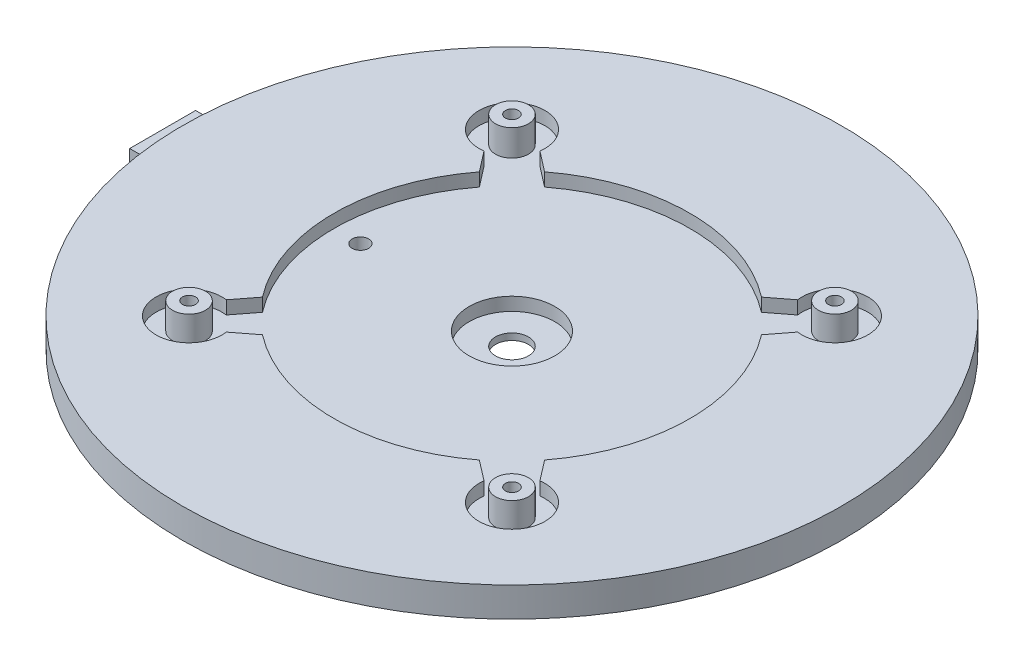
ISO-10303-21;
HEADER;
FILE_DESCRIPTION(('STEP AP214'),'2;1');
FILE_NAME('part.step','',(''),(''),'','','');
FILE_SCHEMA(('AUTOMOTIVE_DESIGN { 1 0 10303 214 1 1 1 1 }'));
ENDSEC;
DATA;
#1=APPLICATION_CONTEXT('core data for automotive mechanical design processes');
#2=APPLICATION_PROTOCOL_DEFINITION('international standard','automotive_design',2000,#1);
#3=PRODUCT_CONTEXT('',#1,'mechanical');
#4=PRODUCT('Part','Part','',(#3));
#5=PRODUCT_RELATED_PRODUCT_CATEGORY('part','',(#4));
#6=PRODUCT_DEFINITION_FORMATION('','',#4);
#7=PRODUCT_DEFINITION_CONTEXT('part definition',#1,'design');
#8=PRODUCT_DEFINITION('design','',#6,#7);
#9=PRODUCT_DEFINITION_SHAPE('','',#8);
#10=(LENGTH_UNIT() NAMED_UNIT(*) SI_UNIT(.MILLI.,.METRE.));
#11=(NAMED_UNIT(*) PLANE_ANGLE_UNIT() SI_UNIT($,.RADIAN.));
#12=(NAMED_UNIT(*) SI_UNIT($,.STERADIAN.) SOLID_ANGLE_UNIT());
#13=UNCERTAINTY_MEASURE_WITH_UNIT(LENGTH_MEASURE(1.E-05),#10,'distance_accuracy_value','');
#14=(GEOMETRIC_REPRESENTATION_CONTEXT(3) GLOBAL_UNCERTAINTY_ASSIGNED_CONTEXT((#13)) GLOBAL_UNIT_ASSIGNED_CONTEXT((#10,
#11,#12)) REPRESENTATION_CONTEXT('',''));
#15=CARTESIAN_POINT('',(0.,0.,0.));
#16=DIRECTION('',(0.,0.,1.));
#17=DIRECTION('',(1.,0.,0.));
#18=AXIS2_PLACEMENT_3D('',#15,#16,#17);
#19=CARTESIAN_POINT('',(0.,-4.5,0.));
#20=DIRECTION('',(0.,1.,0.));
#21=DIRECTION('',(0.,0.,1.));
#22=AXIS2_PLACEMENT_3D('',#19,#20,#21);
#23=PLANE('',#22);
#24=CARTESIAN_POINT('',(0.,-4.5,14.));
#25=DIRECTION('',(0.,1.,0.));
#26=DIRECTION('',(0.,0.,1.));
#27=AXIS2_PLACEMENT_3D('',#24,#25,#26);
#28=CIRCLE('',#27,1.5);
#29=CARTESIAN_POINT('',(0.,-4.5,15.5));
#30=VERTEX_POINT('',#29);
#31=EDGE_CURVE('E590',#30,#30,#28,.F.);
#32=ORIENTED_EDGE('',*,*,#31,.T.);
#33=EDGE_LOOP('',(#32));
#34=FACE_BOUND('',#33,.T.);
#35=ADVANCED_FACE('F17',(#34),#23,.F.);
#36=CARTESIAN_POINT('',(0.,-4.5,0.));
#37=DIRECTION('',(0.,1.,0.));
#38=DIRECTION('',(0.,0.,1.));
#39=AXIS2_PLACEMENT_3D('',#36,#37,#38);
#40=PLANE('',#39);
#41=CARTESIAN_POINT('',(0.,-4.5,-14.));
#42=DIRECTION('',(0.,1.,0.));
#43=DIRECTION('',(0.,0.,1.));
#44=AXIS2_PLACEMENT_3D('',#41,#42,#43);
#45=CIRCLE('',#44,1.5);
#46=CARTESIAN_POINT('',(0.,-4.5,-12.5));
#47=VERTEX_POINT('',#46);
#48=EDGE_CURVE('E587',#47,#47,#45,.F.);
#49=ORIENTED_EDGE('',*,*,#48,.T.);
#50=EDGE_LOOP('',(#49));
#51=FACE_BOUND('',#50,.T.);
#52=ADVANCED_FACE('F1155',(#51),#40,.F.);
#53=CARTESIAN_POINT('',(0.,-4.5,0.));
#54=DIRECTION('',(0.,1.,0.));
#55=DIRECTION('',(0.,0.,1.));
#56=AXIS2_PLACEMENT_3D('',#53,#54,#55);
#57=PLANE('',#56);
#58=CARTESIAN_POINT('',(-14.,-4.5,0.));
#59=DIRECTION('',(0.,1.,0.));
#60=DIRECTION('',(0.,0.,1.));
#61=AXIS2_PLACEMENT_3D('',#58,#59,#60);
#62=CIRCLE('',#61,1.5);
#63=CARTESIAN_POINT('',(-14.,-4.5,1.5));
#64=VERTEX_POINT('',#63);
#65=EDGE_CURVE('E584',#64,#64,#62,.F.);
#66=ORIENTED_EDGE('',*,*,#65,.T.);
#67=EDGE_LOOP('',(#66));
#68=FACE_BOUND('',#67,.T.);
#69=ADVANCED_FACE('F1152',(#68),#57,.F.);
#70=CARTESIAN_POINT('',(0.,-4.5,0.));
#71=DIRECTION('',(0.,1.,0.));
#72=DIRECTION('',(0.,0.,1.));
#73=AXIS2_PLACEMENT_3D('',#70,#71,#72);
#74=PLANE('',#73);
#75=CARTESIAN_POINT('',(14.,-4.5,0.));
#76=DIRECTION('',(0.,1.,0.));
#77=DIRECTION('',(0.,0.,1.));
#78=AXIS2_PLACEMENT_3D('',#75,#76,#77);
#79=CIRCLE('',#78,1.5);
#80=CARTESIAN_POINT('',(14.,-4.5,1.5));
#81=VERTEX_POINT('',#80);
#82=EDGE_CURVE('E581',#81,#81,#79,.F.);
#83=ORIENTED_EDGE('',*,*,#82,.T.);
#84=EDGE_LOOP('',(#83));
#85=FACE_BOUND('',#84,.T.);
#86=ADVANCED_FACE('F1148',(#85),#74,.F.);
#87=CARTESIAN_POINT('',(0.,-4.5,0.));
#88=DIRECTION('',(0.,1.,0.));
#89=DIRECTION('',(0.,0.,1.));
#90=AXIS2_PLACEMENT_3D('',#87,#88,#89);
#91=PLANE('',#90);
#92=CARTESIAN_POINT('',(0.,-4.5,0.));
#93=DIRECTION('',(0.,1.,0.));
#94=DIRECTION('',(0.,0.,1.));
#95=AXIS2_PLACEMENT_3D('',#92,#93,#94);
#96=CIRCLE('',#95,7.5);
#97=CARTESIAN_POINT('',(0.,-4.5,7.5));
#98=VERTEX_POINT('',#97);
#99=EDGE_CURVE('E578',#98,#98,#96,.F.);
#100=ORIENTED_EDGE('',*,*,#99,.F.);
#101=EDGE_LOOP('',(#100));
#102=FACE_BOUND('',#101,.T.);
#103=CARTESIAN_POINT('',(0.,-4.5,0.));
#104=DIRECTION('',(0.,1.,0.));
#105=DIRECTION('',(0.,0.,1.));
#106=AXIS2_PLACEMENT_3D('',#103,#104,#105);
#107=CIRCLE('',#106,16.);
#108=CARTESIAN_POINT('',(15.9196428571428,-4.5,1.60155277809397));
#109=VERTEX_POINT('',#108);
#110=CARTESIAN_POINT('',(1.60155277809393,-4.5,15.9196428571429));
#111=VERTEX_POINT('',#110);
#112=EDGE_CURVE('E20',#109,#111,#107,.F.);
#113=ORIENTED_EDGE('',*,*,#112,.T.);
#114=CARTESIAN_POINT('',(0.,-4.5,14.));
#115=DIRECTION('',(0.,1.,0.));
#116=DIRECTION('',(0.,0.,1.));
#117=AXIS2_PLACEMENT_3D('',#114,#115,#116);
#118=CIRCLE('',#117,2.5);
#119=CARTESIAN_POINT('',(-1.60155277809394,-4.5,15.9196428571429));
#120=VERTEX_POINT('',#119);
#121=EDGE_CURVE('E593',#120,#111,#118,.F.);
#122=ORIENTED_EDGE('',*,*,#121,.F.);
#123=CARTESIAN_POINT('',(0.,-4.5,0.));
#124=DIRECTION('',(0.,1.,0.));
#125=DIRECTION('',(0.,0.,1.));
#126=AXIS2_PLACEMENT_3D('',#123,#124,#125);
#127=CIRCLE('',#126,16.);
#128=CARTESIAN_POINT('',(-15.9196428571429,-4.5,1.60155277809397));
#129=VERTEX_POINT('',#128);
#130=EDGE_CURVE('E596',#120,#129,#127,.F.);
#131=ORIENTED_EDGE('',*,*,#130,.T.);
#132=CARTESIAN_POINT('',(-14.,-4.5,0.));
#133=DIRECTION('',(0.,1.,0.));
#134=DIRECTION('',(0.,0.,1.));
#135=AXIS2_PLACEMENT_3D('',#132,#133,#134);
#136=CIRCLE('',#135,2.5);
#137=CARTESIAN_POINT('',(-15.9196428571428,-4.5,-1.60155277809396));
#138=VERTEX_POINT('',#137);
#139=EDGE_CURVE('E599',#138,#129,#136,.F.);
#140=ORIENTED_EDGE('',*,*,#139,.F.);
#141=CARTESIAN_POINT('',(0.,-4.5,0.));
#142=DIRECTION('',(0.,1.,0.));
#143=DIRECTION('',(0.,0.,1.));
#144=AXIS2_PLACEMENT_3D('',#141,#142,#143);
#145=CIRCLE('',#144,16.);
#146=CARTESIAN_POINT('',(-1.60155277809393,-4.5,-15.9196428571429));
#147=VERTEX_POINT('',#146);
#148=EDGE_CURVE('E603',#138,#147,#145,.F.);
#149=ORIENTED_EDGE('',*,*,#148,.T.);
#150=CARTESIAN_POINT('',(0.,-4.5,-14.));
#151=DIRECTION('',(0.,1.,0.));
#152=DIRECTION('',(0.,0.,1.));
#153=AXIS2_PLACEMENT_3D('',#150,#151,#152);
#154=CIRCLE('',#153,2.5);
#155=CARTESIAN_POINT('',(1.60155277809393,-4.5,-15.9196428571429));
#156=VERTEX_POINT('',#155);
#157=EDGE_CURVE('E607',#156,#147,#154,.F.);
#158=ORIENTED_EDGE('',*,*,#157,.F.);
#159=CARTESIAN_POINT('',(0.,-4.5,0.));
#160=DIRECTION('',(0.,1.,0.));
#161=DIRECTION('',(0.,0.,1.));
#162=AXIS2_PLACEMENT_3D('',#159,#160,#161);
#163=CIRCLE('',#162,16.);
#164=CARTESIAN_POINT('',(15.9196428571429,-4.5,-1.60155277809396));
#165=VERTEX_POINT('',#164);
#166=EDGE_CURVE('E307',#156,#165,#163,.F.);
#167=ORIENTED_EDGE('',*,*,#166,.T.);
#168=CARTESIAN_POINT('',(14.,-4.5,0.));
#169=DIRECTION('',(0.,1.,0.));
#170=DIRECTION('',(0.,0.,1.));
#171=AXIS2_PLACEMENT_3D('',#168,#169,#170);
#172=CIRCLE('',#171,2.5);
#173=EDGE_CURVE('E301',#109,#165,#172,.F.);
#174=ORIENTED_EDGE('',*,*,#173,.F.);
#175=EDGE_LOOP('',(#113,#122,#131,#140,#149,#158,#167,#174));
#176=FACE_BOUND('',#175,.T.);
#177=ADVANCED_FACE('F303',(#102,#176),#91,.F.);
#178=CARTESIAN_POINT('',(0.,-9.5,0.));
#179=DIRECTION('',(0.,1.,0.));
#180=DIRECTION('',(0.,0.,1.));
#181=AXIS2_PLACEMENT_3D('',#178,#179,#180);
#182=CYLINDRICAL_SURFACE('',#181,16.);
#183=DIRECTION('',(0.,1.,0.));
#184=VECTOR('',#183,1.);
#185=CARTESIAN_POINT('',(15.9196428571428,-9.5,1.60155277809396));
#186=LINE('',#185,#184);
#187=CARTESIAN_POINT('',(15.9196428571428,-9.5,1.60155277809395));
#188=VERTEX_POINT('',#187);
#189=EDGE_CURVE('E311',#188,#109,#186,.T.);
#190=ORIENTED_EDGE('',*,*,#189,.F.);
#191=CARTESIAN_POINT('',(0.,-9.5,0.));
#192=DIRECTION('',(0.,1.,0.));
#193=DIRECTION('',(0.,0.,1.));
#194=AXIS2_PLACEMENT_3D('',#191,#192,#193);
#195=CIRCLE('',#194,16.);
#196=CARTESIAN_POINT('',(1.60155277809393,-9.5,15.9196428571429));
#197=VERTEX_POINT('',#196);
#198=EDGE_CURVE('E576',#197,#188,#195,.T.);
#199=ORIENTED_EDGE('',*,*,#198,.F.);
#200=DIRECTION('',(0.,1.,0.));
#201=VECTOR('',#200,1.);
#202=CARTESIAN_POINT('',(1.60155277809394,-9.5,15.9196428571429));
#203=LINE('',#202,#201);
#204=EDGE_CURVE('E317',#111,#197,#203,.F.);
#205=ORIENTED_EDGE('',*,*,#204,.F.);
#206=ORIENTED_EDGE('',*,*,#112,.F.);
#207=EDGE_LOOP('',(#190,#199,#205,#206));
#208=FACE_BOUND('',#207,.T.);
#209=ADVANCED_FACE('F314',(#208),#182,.F.);
#210=CARTESIAN_POINT('',(14.,-9.5,0.));
#211=DIRECTION('',(0.,1.,0.));
#212=DIRECTION('',(0.,0.,1.));
#213=AXIS2_PLACEMENT_3D('',#210,#211,#212);
#214=CYLINDRICAL_SURFACE('',#213,2.5);
#215=ORIENTED_EDGE('',*,*,#173,.T.);
#216=DIRECTION('',(0.,1.,0.));
#217=VECTOR('',#216,1.);
#218=CARTESIAN_POINT('',(15.9196428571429,-9.5,-1.60155277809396));
#219=LINE('',#218,#217);
#220=CARTESIAN_POINT('',(15.9196428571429,-9.5,-1.60155277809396));
#221=VERTEX_POINT('',#220);
#222=EDGE_CURVE('E325',#165,#221,#219,.F.);
#223=ORIENTED_EDGE('',*,*,#222,.T.);
#224=CARTESIAN_POINT('',(14.,-9.5,0.));
#225=DIRECTION('',(0.,1.,0.));
#226=DIRECTION('',(0.,0.,1.));
#227=AXIS2_PLACEMENT_3D('',#224,#225,#226);
#228=CIRCLE('',#227,2.5);
#229=EDGE_CURVE('E321',#188,#221,#228,.F.);
#230=ORIENTED_EDGE('',*,*,#229,.F.);
#231=ORIENTED_EDGE('',*,*,#189,.T.);
#232=EDGE_LOOP('',(#215,#223,#230,#231));
#233=FACE_BOUND('',#232,.T.);
#234=ADVANCED_FACE('F319',(#233),#214,.T.);
#235=CARTESIAN_POINT('',(0.,-9.5,0.));
#236=DIRECTION('',(0.,1.,0.));
#237=DIRECTION('',(0.,0.,1.));
#238=AXIS2_PLACEMENT_3D('',#235,#236,#237);
#239=CYLINDRICAL_SURFACE('',#238,16.);
#240=ORIENTED_EDGE('',*,*,#222,.F.);
#241=ORIENTED_EDGE('',*,*,#166,.F.);
#242=DIRECTION('',(0.,1.,0.));
#243=VECTOR('',#242,1.);
#244=CARTESIAN_POINT('',(1.60155277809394,-9.5,-15.9196428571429));
#245=LINE('',#244,#243);
#246=CARTESIAN_POINT('',(1.60155277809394,-9.5,-15.9196428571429));
#247=VERTEX_POINT('',#246);
#248=EDGE_CURVE('E609',#247,#156,#245,.T.);
#249=ORIENTED_EDGE('',*,*,#248,.F.);
#250=CARTESIAN_POINT('',(0.,-9.5,0.));
#251=DIRECTION('',(0.,1.,0.));
#252=DIRECTION('',(0.,0.,1.));
#253=AXIS2_PLACEMENT_3D('',#250,#251,#252);
#254=CIRCLE('',#253,16.);
#255=EDGE_CURVE('E572',#221,#247,#254,.T.);
#256=ORIENTED_EDGE('',*,*,#255,.F.);
#257=EDGE_LOOP('',(#240,#241,#249,#256));
#258=FACE_BOUND('',#257,.T.);
#259=ADVANCED_FACE('F1138',(#258),#239,.F.);
#260=CARTESIAN_POINT('',(0.,-9.5,-14.));
#261=DIRECTION('',(0.,1.,0.));
#262=DIRECTION('',(0.,0.,1.));
#263=AXIS2_PLACEMENT_3D('',#260,#261,#262);
#264=CYLINDRICAL_SURFACE('',#263,2.5);
#265=ORIENTED_EDGE('',*,*,#157,.T.);
#266=DIRECTION('',(0.,1.,0.));
#267=VECTOR('',#266,1.);
#268=CARTESIAN_POINT('',(-1.60155277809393,-9.5,-15.9196428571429));
#269=LINE('',#268,#267);
#270=CARTESIAN_POINT('',(-1.60155277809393,-9.5,-15.9196428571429));
#271=VERTEX_POINT('',#270);
#272=EDGE_CURVE('E606',#147,#271,#269,.F.);
#273=ORIENTED_EDGE('',*,*,#272,.T.);
#274=CARTESIAN_POINT('',(0.,-9.5,-14.));
#275=DIRECTION('',(0.,1.,0.));
#276=DIRECTION('',(0.,0.,1.));
#277=AXIS2_PLACEMENT_3D('',#274,#275,#276);
#278=CIRCLE('',#277,2.5);
#279=EDGE_CURVE('E569',#247,#271,#278,.F.);
#280=ORIENTED_EDGE('',*,*,#279,.F.);
#281=ORIENTED_EDGE('',*,*,#248,.T.);
#282=EDGE_LOOP('',(#265,#273,#280,#281));
#283=FACE_BOUND('',#282,.T.);
#284=ADVANCED_FACE('F1134',(#283),#264,.T.);
#285=CARTESIAN_POINT('',(0.,-9.5,0.));
#286=DIRECTION('',(0.,1.,0.));
#287=DIRECTION('',(0.,0.,1.));
#288=AXIS2_PLACEMENT_3D('',#285,#286,#287);
#289=CYLINDRICAL_SURFACE('',#288,16.);
#290=DIRECTION('',(0.,1.,0.));
#291=VECTOR('',#290,1.);
#292=CARTESIAN_POINT('',(-15.9196428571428,-9.5,-1.60155277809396));
#293=LINE('',#292,#291);
#294=CARTESIAN_POINT('',(-15.9196428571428,-9.5,-1.60155277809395));
#295=VERTEX_POINT('',#294);
#296=EDGE_CURVE('E602',#295,#138,#293,.T.);
#297=ORIENTED_EDGE('',*,*,#296,.F.);
#298=CARTESIAN_POINT('',(0.,-9.5,0.));
#299=DIRECTION('',(0.,1.,0.));
#300=DIRECTION('',(0.,0.,1.));
#301=AXIS2_PLACEMENT_3D('',#298,#299,#300);
#302=CIRCLE('',#301,16.);
#303=EDGE_CURVE('E566',#271,#295,#302,.T.);
#304=ORIENTED_EDGE('',*,*,#303,.F.);
#305=ORIENTED_EDGE('',*,*,#272,.F.);
#306=ORIENTED_EDGE('',*,*,#148,.F.);
#307=EDGE_LOOP('',(#297,#304,#305,#306));
#308=FACE_BOUND('',#307,.T.);
#309=ADVANCED_FACE('F1130',(#308),#289,.F.);
#310=CARTESIAN_POINT('',(-14.,-9.5,0.));
#311=DIRECTION('',(0.,1.,0.));
#312=DIRECTION('',(0.,0.,1.));
#313=AXIS2_PLACEMENT_3D('',#310,#311,#312);
#314=CYLINDRICAL_SURFACE('',#313,2.5);
#315=ORIENTED_EDGE('',*,*,#139,.T.);
#316=DIRECTION('',(0.,1.,0.));
#317=VECTOR('',#316,1.);
#318=CARTESIAN_POINT('',(-15.9196428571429,-9.5,1.60155277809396));
#319=LINE('',#318,#317);
#320=CARTESIAN_POINT('',(-15.9196428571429,-9.5,1.60155277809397));
#321=VERTEX_POINT('',#320);
#322=EDGE_CURVE('E598',#129,#321,#319,.F.);
#323=ORIENTED_EDGE('',*,*,#322,.T.);
#324=CARTESIAN_POINT('',(-14.,-9.5,0.));
#325=DIRECTION('',(0.,1.,0.));
#326=DIRECTION('',(0.,0.,1.));
#327=AXIS2_PLACEMENT_3D('',#324,#325,#326);
#328=CIRCLE('',#327,2.5);
#329=EDGE_CURVE('E563',#295,#321,#328,.F.);
#330=ORIENTED_EDGE('',*,*,#329,.F.);
#331=ORIENTED_EDGE('',*,*,#296,.T.);
#332=EDGE_LOOP('',(#315,#323,#330,#331));
#333=FACE_BOUND('',#332,.T.);
#334=ADVANCED_FACE('F1126',(#333),#314,.T.);
#335=CARTESIAN_POINT('',(0.,-9.5,0.));
#336=DIRECTION('',(0.,1.,0.));
#337=DIRECTION('',(0.,0.,1.));
#338=AXIS2_PLACEMENT_3D('',#335,#336,#337);
#339=CYLINDRICAL_SURFACE('',#338,16.);
#340=ORIENTED_EDGE('',*,*,#322,.F.);
#341=ORIENTED_EDGE('',*,*,#130,.F.);
#342=DIRECTION('',(0.,1.,0.));
#343=VECTOR('',#342,1.);
#344=CARTESIAN_POINT('',(-1.60155277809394,-9.5,15.9196428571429));
#345=LINE('',#344,#343);
#346=CARTESIAN_POINT('',(-1.60155277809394,-9.5,15.9196428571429));
#347=VERTEX_POINT('',#346);
#348=EDGE_CURVE('E595',#347,#120,#345,.T.);
#349=ORIENTED_EDGE('',*,*,#348,.F.);
#350=CARTESIAN_POINT('',(0.,-9.5,0.));
#351=DIRECTION('',(0.,1.,0.));
#352=DIRECTION('',(0.,0.,1.));
#353=AXIS2_PLACEMENT_3D('',#350,#351,#352);
#354=CIRCLE('',#353,16.);
#355=EDGE_CURVE('E560',#321,#347,#354,.T.);
#356=ORIENTED_EDGE('',*,*,#355,.F.);
#357=EDGE_LOOP('',(#340,#341,#349,#356));
#358=FACE_BOUND('',#357,.T.);
#359=ADVANCED_FACE('F1122',(#358),#339,.F.);
#360=CARTESIAN_POINT('',(0.,-9.5,14.));
#361=DIRECTION('',(0.,1.,0.));
#362=DIRECTION('',(0.,0.,1.));
#363=AXIS2_PLACEMENT_3D('',#360,#361,#362);
#364=CYLINDRICAL_SURFACE('',#363,2.5);
#365=ORIENTED_EDGE('',*,*,#348,.T.);
#366=ORIENTED_EDGE('',*,*,#121,.T.);
#367=ORIENTED_EDGE('',*,*,#204,.T.);
#368=CARTESIAN_POINT('',(0.,-9.5,14.));
#369=DIRECTION('',(0.,1.,0.));
#370=DIRECTION('',(0.,0.,1.));
#371=AXIS2_PLACEMENT_3D('',#368,#369,#370);
#372=CIRCLE('',#371,2.5);
#373=EDGE_CURVE('E557',#347,#197,#372,.F.);
#374=ORIENTED_EDGE('',*,*,#373,.F.);
#375=EDGE_LOOP('',(#365,#366,#367,#374));
#376=FACE_BOUND('',#375,.T.);
#377=ADVANCED_FACE('F1118',(#376),#364,.T.);
#378=CARTESIAN_POINT('',(0.,-9.5,14.));
#379=DIRECTION('',(0.,1.,0.));
#380=DIRECTION('',(0.,0.,1.));
#381=AXIS2_PLACEMENT_3D('',#378,#379,#380);
#382=CYLINDRICAL_SURFACE('',#381,1.5);
#383=CARTESIAN_POINT('',(0.,-9.5,14.));
#384=DIRECTION('',(0.,1.,0.));
#385=DIRECTION('',(0.,0.,1.));
#386=AXIS2_PLACEMENT_3D('',#383,#384,#385);
#387=CIRCLE('',#386,1.5);
#388=CARTESIAN_POINT('',(0.,-9.5,15.5));
#389=VERTEX_POINT('',#388);
#390=EDGE_CURVE('E554',#389,#389,#387,.T.);
#391=ORIENTED_EDGE('',*,*,#390,.F.);
#392=EDGE_LOOP('',(#391));
#393=FACE_BOUND('',#392,.T.);
#394=ORIENTED_EDGE('',*,*,#31,.F.);
#395=EDGE_LOOP('',(#394));
#396=FACE_BOUND('',#395,.T.);
#397=ADVANCED_FACE('F1114',(#393,#396),#382,.F.);
#398=CARTESIAN_POINT('',(0.,-9.5,-14.));
#399=DIRECTION('',(0.,1.,0.));
#400=DIRECTION('',(0.,0.,1.));
#401=AXIS2_PLACEMENT_3D('',#398,#399,#400);
#402=CYLINDRICAL_SURFACE('',#401,1.5);
#403=CARTESIAN_POINT('',(0.,-9.5,-14.));
#404=DIRECTION('',(0.,1.,0.));
#405=DIRECTION('',(0.,0.,1.));
#406=AXIS2_PLACEMENT_3D('',#403,#404,#405);
#407=CIRCLE('',#406,1.5);
#408=CARTESIAN_POINT('',(0.,-9.5,-12.5));
#409=VERTEX_POINT('',#408);
#410=EDGE_CURVE('E551',#409,#409,#407,.T.);
#411=ORIENTED_EDGE('',*,*,#410,.F.);
#412=EDGE_LOOP('',(#411));
#413=FACE_BOUND('',#412,.T.);
#414=ORIENTED_EDGE('',*,*,#48,.F.);
#415=EDGE_LOOP('',(#414));
#416=FACE_BOUND('',#415,.T.);
#417=ADVANCED_FACE('F1110',(#413,#416),#402,.F.);
#418=CARTESIAN_POINT('',(-14.,-9.5,0.));
#419=DIRECTION('',(0.,1.,0.));
#420=DIRECTION('',(0.,0.,1.));
#421=AXIS2_PLACEMENT_3D('',#418,#419,#420);
#422=CYLINDRICAL_SURFACE('',#421,1.5);
#423=CARTESIAN_POINT('',(-14.,-9.5,0.));
#424=DIRECTION('',(0.,1.,0.));
#425=DIRECTION('',(0.,0.,1.));
#426=AXIS2_PLACEMENT_3D('',#423,#424,#425);
#427=CIRCLE('',#426,1.5);
#428=CARTESIAN_POINT('',(-14.,-9.5,1.5));
#429=VERTEX_POINT('',#428);
#430=EDGE_CURVE('E548',#429,#429,#427,.T.);
#431=ORIENTED_EDGE('',*,*,#430,.F.);
#432=EDGE_LOOP('',(#431));
#433=FACE_BOUND('',#432,.T.);
#434=ORIENTED_EDGE('',*,*,#65,.F.);
#435=EDGE_LOOP('',(#434));
#436=FACE_BOUND('',#435,.T.);
#437=ADVANCED_FACE('F1106',(#433,#436),#422,.F.);
#438=CARTESIAN_POINT('',(14.,-9.5,0.));
#439=DIRECTION('',(0.,1.,0.));
#440=DIRECTION('',(0.,0.,1.));
#441=AXIS2_PLACEMENT_3D('',#438,#439,#440);
#442=CYLINDRICAL_SURFACE('',#441,1.5);
#443=CARTESIAN_POINT('',(14.,-9.5,0.));
#444=DIRECTION('',(0.,1.,0.));
#445=DIRECTION('',(0.,0.,1.));
#446=AXIS2_PLACEMENT_3D('',#443,#444,#445);
#447=CIRCLE('',#446,1.5);
#448=CARTESIAN_POINT('',(14.,-9.5,1.5));
#449=VERTEX_POINT('',#448);
#450=EDGE_CURVE('E545',#449,#449,#447,.T.);
#451=ORIENTED_EDGE('',*,*,#450,.F.);
#452=EDGE_LOOP('',(#451));
#453=FACE_BOUND('',#452,.T.);
#454=ORIENTED_EDGE('',*,*,#82,.F.);
#455=EDGE_LOOP('',(#454));
#456=FACE_BOUND('',#455,.T.);
#457=ADVANCED_FACE('F1102',(#453,#456),#442,.F.);
#458=CARTESIAN_POINT('',(0.,-4.,0.));
#459=DIRECTION('',(0.,1.,0.));
#460=DIRECTION('',(0.,0.,1.));
#461=AXIS2_PLACEMENT_3D('',#458,#459,#460);
#462=CYLINDRICAL_SURFACE('',#461,7.5);
#463=ORIENTED_EDGE('',*,*,#99,.T.);
#464=EDGE_LOOP('',(#463));
#465=FACE_BOUND('',#464,.T.);
#466=CARTESIAN_POINT('',(0.,-5.,0.));
#467=DIRECTION('',(0.,1.,0.));
#468=DIRECTION('',(0.,0.,1.));
#469=AXIS2_PLACEMENT_3D('',#466,#467,#468);
#470=CIRCLE('',#469,7.5);
#471=CARTESIAN_POINT('',(0.,-5.,7.5));
#472=VERTEX_POINT('',#471);
#473=EDGE_CURVE('E542',#472,#472,#470,.T.);
#474=ORIENTED_EDGE('',*,*,#473,.T.);
#475=EDGE_LOOP('',(#474));
#476=FACE_BOUND('',#475,.T.);
#477=ADVANCED_FACE('F1098',(#465,#476),#462,.T.);
#478=CARTESIAN_POINT('',(0.,-9.5,0.));
#479=DIRECTION('',(0.,-1.,0.));
#480=DIRECTION('',(0.,0.,-1.));
#481=AXIS2_PLACEMENT_3D('',#478,#479,#480);
#482=PLANE('',#481);
#483=ORIENTED_EDGE('',*,*,#450,.T.);
#484=EDGE_LOOP('',(#483));
#485=FACE_BOUND('',#484,.T.);
#486=ORIENTED_EDGE('',*,*,#430,.T.);
#487=EDGE_LOOP('',(#486));
#488=FACE_BOUND('',#487,.T.);
#489=ORIENTED_EDGE('',*,*,#410,.T.);
#490=EDGE_LOOP('',(#489));
#491=FACE_BOUND('',#490,.T.);
#492=ORIENTED_EDGE('',*,*,#390,.T.);
#493=EDGE_LOOP('',(#492));
#494=FACE_BOUND('',#493,.T.);
#495=ORIENTED_EDGE('',*,*,#355,.T.);
#496=ORIENTED_EDGE('',*,*,#373,.T.);
#497=ORIENTED_EDGE('',*,*,#198,.T.);
#498=ORIENTED_EDGE('',*,*,#229,.T.);
#499=ORIENTED_EDGE('',*,*,#255,.T.);
#500=ORIENTED_EDGE('',*,*,#279,.T.);
#501=ORIENTED_EDGE('',*,*,#303,.T.);
#502=ORIENTED_EDGE('',*,*,#329,.T.);
#503=EDGE_LOOP('',(#495,#496,#497,#498,#499,#500,#501,#502));
#504=FACE_BOUND('',#503,.T.);
#505=CARTESIAN_POINT('',(0.,-9.5,0.));
#506=DIRECTION('',(0.,1.,0.));
#507=DIRECTION('',(0.,0.,1.));
#508=AXIS2_PLACEMENT_3D('',#505,#506,#507);
#509=CIRCLE('',#508,18.);
#510=CARTESIAN_POINT('',(0.,-9.5,18.));
#511=VERTEX_POINT('',#510);
#512=EDGE_CURVE('E538',#511,#511,#509,.T.);
#513=ORIENTED_EDGE('',*,*,#512,.F.);
#514=EDGE_LOOP('',(#513));
#515=FACE_BOUND('',#514,.T.);
#516=ADVANCED_FACE('F1094',(#485,#488,#491,#494,#504,#515),#482,.T.);
#517=CARTESIAN_POINT('',(0.,-5.,0.));
#518=DIRECTION('',(0.,1.,0.));
#519=DIRECTION('',(0.,0.,1.));
#520=AXIS2_PLACEMENT_3D('',#517,#518,#519);
#521=PLANE('',#520);
#522=ORIENTED_EDGE('',*,*,#473,.F.);
#523=EDGE_LOOP('',(#522));
#524=FACE_BOUND('',#523,.T.);
#525=CARTESIAN_POINT('',(0.,-5.,0.));
#526=DIRECTION('',(0.,1.,0.));
#527=DIRECTION('',(0.,0.,1.));
#528=AXIS2_PLACEMENT_3D('',#525,#526,#527);
#529=CIRCLE('',#528,2.5);
#530=CARTESIAN_POINT('',(0.,-5.,2.5));
#531=VERTEX_POINT('',#530);
#532=EDGE_CURVE('E534',#531,#531,#529,.T.);
#533=ORIENTED_EDGE('',*,*,#532,.T.);
#534=EDGE_LOOP('',(#533));
#535=FACE_BOUND('',#534,.T.);
#536=ADVANCED_FACE('F1090',(#524,#535),#521,.F.);
#537=CARTESIAN_POINT('',(0.,-9.5,0.));
#538=DIRECTION('',(0.,1.,0.));
#539=DIRECTION('',(0.,0.,1.));
#540=AXIS2_PLACEMENT_3D('',#537,#538,#539);
#541=CYLINDRICAL_SURFACE('',#540,18.);
#542=ORIENTED_EDGE('',*,*,#512,.T.);
#543=EDGE_LOOP('',(#542));
#544=FACE_BOUND('',#543,.T.);
#545=CARTESIAN_POINT('',(0.,-4.5,0.));
#546=DIRECTION('',(0.,1.,0.));
#547=DIRECTION('',(0.,0.,1.));
#548=AXIS2_PLACEMENT_3D('',#545,#546,#547);
#549=CIRCLE('',#548,18.);
#550=CARTESIAN_POINT('',(0.,-4.5,18.));
#551=VERTEX_POINT('',#550);
#552=EDGE_CURVE('E501',#551,#551,#549,.F.);
#553=ORIENTED_EDGE('',*,*,#552,.T.);
#554=EDGE_LOOP('',(#553));
#555=FACE_BOUND('',#554,.T.);
#556=ADVANCED_FACE('F1086',(#544,#555),#541,.T.);
#557=CARTESIAN_POINT('',(-4.82336341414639,-2.,6.25206566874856));
#558=DIRECTION('',(-0.610830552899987,0.,0.791761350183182));
#559=DIRECTION('',(0.791761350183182,0.,0.610830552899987));
#560=AXIS2_PLACEMENT_3D('',#557,#558,#559);
#561=PLANE('',#560);
#562=DIRECTION('',(0.791761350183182,0.,0.610830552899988));
#563=VECTOR('',#562,1.);
#564=CARTESIAN_POINT('',(16.4461059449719,-4.5,22.6611032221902));
#565=LINE('',#564,#563);
#566=CARTESIAN_POINT('',(16.4461059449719,-4.5,22.6611032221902));
#567=VERTEX_POINT('',#566);
#568=CARTESIAN_POINT('',(18.5052240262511,-4.5,24.2496781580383));
#569=VERTEX_POINT('',#568);
#570=EDGE_CURVE('E488',#567,#569,#565,.T.);
#571=ORIENTED_EDGE('',*,*,#570,.T.);
#572=DIRECTION('',(0.,1.,0.));
#573=VECTOR('',#572,1.);
#574=CARTESIAN_POINT('',(18.5052240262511,-2.,24.2496781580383));
#575=LINE('',#574,#573);
#576=CARTESIAN_POINT('',(18.5052240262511,-1.,24.2496781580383));
#577=VERTEX_POINT('',#576);
#578=EDGE_CURVE('E624',#577,#569,#575,.F.);
#579=ORIENTED_EDGE('',*,*,#578,.F.);
#580=DIRECTION('',(-0.791761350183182,0.,-0.610830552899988));
#581=VECTOR('',#580,1.);
#582=CARTESIAN_POINT('',(18.5052240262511,-1.,24.2496781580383));
#583=LINE('',#582,#581);
#584=CARTESIAN_POINT('',(16.4461059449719,-1.,22.6611032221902));
#585=VERTEX_POINT('',#584);
#586=EDGE_CURVE('E507',#577,#585,#583,.T.);
#587=ORIENTED_EDGE('',*,*,#586,.T.);
#588=DIRECTION('',(0.,1.,0.));
#589=VECTOR('',#588,1.);
#590=CARTESIAN_POINT('',(16.4461059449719,-2.,22.6611032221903));
#591=LINE('',#590,#589);
#592=EDGE_CURVE('E541',#585,#567,#591,.F.);
#593=ORIENTED_EDGE('',*,*,#592,.T.);
#594=EDGE_LOOP('',(#571,#579,#587,#593));
#595=FACE_BOUND('',#594,.T.);
#596=ADVANCED_FACE('F1082',(#595),#561,.T.);
#597=CARTESIAN_POINT('',(24.5,-2.,24.5));
#598=DIRECTION('',(0.,1.,0.));
#599=DIRECTION('',(0.,0.,1.));
#600=AXIS2_PLACEMENT_3D('',#597,#598,#599);
#601=CYLINDRICAL_SURFACE('',#600,6.);
#602=DIRECTION('',(0.,1.,0.));
#603=VECTOR('',#602,1.);
#604=CARTESIAN_POINT('',(24.2496781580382,-2.,18.5052240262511));
#605=LINE('',#604,#603);
#606=CARTESIAN_POINT('',(24.2496781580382,-4.5,18.5052240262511));
#607=VERTEX_POINT('',#606);
#608=CARTESIAN_POINT('',(24.2496781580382,-1.,18.5052240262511));
#609=VERTEX_POINT('',#608);
#610=EDGE_CURVE('E627',#607,#609,#605,.T.);
#611=ORIENTED_EDGE('',*,*,#610,.T.);
#612=CARTESIAN_POINT('',(24.5,-1.,24.5));
#613=DIRECTION('',(0.,1.,0.));
#614=DIRECTION('',(0.,0.,1.));
#615=AXIS2_PLACEMENT_3D('',#612,#613,#614);
#616=CIRCLE('',#615,6.);
#617=EDGE_CURVE('E508',#609,#577,#616,.F.);
#618=ORIENTED_EDGE('',*,*,#617,.T.);
#619=ORIENTED_EDGE('',*,*,#578,.T.);
#620=CARTESIAN_POINT('',(24.5,-4.5,24.5));
#621=DIRECTION('',(0.,1.,0.));
#622=DIRECTION('',(0.,0.,1.));
#623=AXIS2_PLACEMENT_3D('',#620,#621,#622);
#624=CIRCLE('',#623,6.);
#625=EDGE_CURVE('E486',#569,#607,#624,.T.);
#626=ORIENTED_EDGE('',*,*,#625,.T.);
#627=EDGE_LOOP('',(#611,#618,#619,#626));
#628=FACE_BOUND('',#627,.T.);
#629=ADVANCED_FACE('F1078',(#628),#601,.T.);
#630=CARTESIAN_POINT('',(6.25206566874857,-2.,-4.8233634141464));
#631=DIRECTION('',(-0.791761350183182,0.,0.610830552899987));
#632=DIRECTION('',(0.610830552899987,0.,0.791761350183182));
#633=AXIS2_PLACEMENT_3D('',#630,#631,#632);
#634=PLANE('',#633);
#635=ORIENTED_EDGE('',*,*,#610,.F.);
#636=DIRECTION('',(-0.610830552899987,0.,-0.791761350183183));
#637=VECTOR('',#636,1.);
#638=CARTESIAN_POINT('',(24.2496781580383,-4.5,18.5052240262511));
#639=LINE('',#638,#637);
#640=CARTESIAN_POINT('',(22.6611032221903,-4.5,16.4461059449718));
#641=VERTEX_POINT('',#640);
#642=EDGE_CURVE('E485',#607,#641,#639,.T.);
#643=ORIENTED_EDGE('',*,*,#642,.T.);
#644=DIRECTION('',(0.,1.,0.));
#645=VECTOR('',#644,1.);
#646=CARTESIAN_POINT('',(22.6611032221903,-2.,16.4461059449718));
#647=LINE('',#646,#645);
#648=CARTESIAN_POINT('',(22.6611032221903,-1.,16.4461059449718));
#649=VERTEX_POINT('',#648);
#650=EDGE_CURVE('E630',#649,#641,#647,.F.);
#651=ORIENTED_EDGE('',*,*,#650,.F.);
#652=DIRECTION('',(0.610830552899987,0.,0.791761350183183));
#653=VECTOR('',#652,1.);
#654=CARTESIAN_POINT('',(22.6611032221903,-1.,16.4461059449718));
#655=LINE('',#654,#653);
#656=EDGE_CURVE('E511',#649,#609,#655,.T.);
#657=ORIENTED_EDGE('',*,*,#656,.T.);
#658=EDGE_LOOP('',(#635,#643,#651,#657));
#659=FACE_BOUND('',#658,.T.);
#660=ADVANCED_FACE('F1074',(#659),#634,.F.);
#661=CARTESIAN_POINT('',(0.,-2.,0.));
#662=DIRECTION('',(0.,1.,0.));
#663=DIRECTION('',(0.,0.,1.));
#664=AXIS2_PLACEMENT_3D('',#661,#662,#663);
#665=CYLINDRICAL_SURFACE('',#664,28.);
#666=CARTESIAN_POINT('',(0.,-4.5,0.));
#667=DIRECTION('',(0.,1.,0.));
#668=DIRECTION('',(0.,0.,1.));
#669=AXIS2_PLACEMENT_3D('',#666,#667,#668);
#670=CIRCLE('',#669,28.);
#671=CARTESIAN_POINT('',(22.6611032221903,-4.5,-16.4461059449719));
#672=VERTEX_POINT('',#671);
#673=EDGE_CURVE('E483',#641,#672,#670,.T.);
#674=ORIENTED_EDGE('',*,*,#673,.T.);
#675=DIRECTION('',(0.,1.,0.));
#676=VECTOR('',#675,1.);
#677=CARTESIAN_POINT('',(22.6611032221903,-2.,-16.4461059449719));
#678=LINE('',#677,#676);
#679=CARTESIAN_POINT('',(22.6611032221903,-1.,-16.4461059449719));
#680=VERTEX_POINT('',#679);
#681=EDGE_CURVE('E633',#680,#672,#678,.F.);
#682=ORIENTED_EDGE('',*,*,#681,.F.);
#683=CARTESIAN_POINT('',(0.,-1.,0.));
#684=DIRECTION('',(0.,1.,0.));
#685=DIRECTION('',(0.,0.,1.));
#686=AXIS2_PLACEMENT_3D('',#683,#684,#685);
#687=CIRCLE('',#686,28.);
#688=EDGE_CURVE('E512',#680,#649,#687,.F.);
#689=ORIENTED_EDGE('',*,*,#688,.T.);
#690=ORIENTED_EDGE('',*,*,#650,.T.);
#691=EDGE_LOOP('',(#674,#682,#689,#690));
#692=FACE_BOUND('',#691,.T.);
#693=ADVANCED_FACE('F1070',(#692),#665,.T.);
#694=CARTESIAN_POINT('',(6.25206566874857,-2.,4.8233634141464));
#695=DIRECTION('',(0.791761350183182,0.,0.610830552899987));
#696=DIRECTION('',(0.610830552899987,0.,-0.791761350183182));
#697=AXIS2_PLACEMENT_3D('',#694,#695,#696);
#698=PLANE('',#697);
#699=DIRECTION('',(0.610830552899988,0.,-0.791761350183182));
#700=VECTOR('',#699,1.);
#701=CARTESIAN_POINT('',(22.6611032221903,-4.5,-16.4461059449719));
#702=LINE('',#701,#700);
#703=CARTESIAN_POINT('',(24.2496781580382,-4.5,-18.5052240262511));
#704=VERTEX_POINT('',#703);
#705=EDGE_CURVE('E482',#672,#704,#702,.T.);
#706=ORIENTED_EDGE('',*,*,#705,.T.);
#707=DIRECTION('',(0.,1.,0.));
#708=VECTOR('',#707,1.);
#709=CARTESIAN_POINT('',(24.2496781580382,-2.,-18.5052240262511));
#710=LINE('',#709,#708);
#711=CARTESIAN_POINT('',(24.2496781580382,-1.,-18.5052240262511));
#712=VERTEX_POINT('',#711);
#713=EDGE_CURVE('E634',#704,#712,#710,.T.);
#714=ORIENTED_EDGE('',*,*,#713,.T.);
#715=DIRECTION('',(-0.610830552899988,0.,0.791761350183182));
#716=VECTOR('',#715,1.);
#717=CARTESIAN_POINT('',(24.2496781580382,-1.,-18.5052240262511));
#718=LINE('',#717,#716);
#719=EDGE_CURVE('E515',#712,#680,#718,.T.);
#720=ORIENTED_EDGE('',*,*,#719,.T.);
#721=ORIENTED_EDGE('',*,*,#681,.T.);
#722=EDGE_LOOP('',(#706,#714,#720,#721));
#723=FACE_BOUND('',#722,.T.);
#724=ADVANCED_FACE('F1066',(#723),#698,.T.);
#725=CARTESIAN_POINT('',(24.5,-2.,-24.5));
#726=DIRECTION('',(0.,1.,0.));
#727=DIRECTION('',(0.,0.,1.));
#728=AXIS2_PLACEMENT_3D('',#725,#726,#727);
#729=CYLINDRICAL_SURFACE('',#728,6.);
#730=DIRECTION('',(0.,1.,0.));
#731=VECTOR('',#730,1.);
#732=CARTESIAN_POINT('',(18.5052240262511,-2.,-24.2496781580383));
#733=LINE('',#732,#731);
#734=CARTESIAN_POINT('',(18.5052240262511,-4.5,-24.2496781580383));
#735=VERTEX_POINT('',#734);
#736=CARTESIAN_POINT('',(18.5052240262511,-1.,-24.2496781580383));
#737=VERTEX_POINT('',#736);
#738=EDGE_CURVE('E637',#735,#737,#733,.T.);
#739=ORIENTED_EDGE('',*,*,#738,.T.);
#740=CARTESIAN_POINT('',(24.5,-1.,-24.5));
#741=DIRECTION('',(0.,1.,0.));
#742=DIRECTION('',(0.,0.,1.));
#743=AXIS2_PLACEMENT_3D('',#740,#741,#742);
#744=CIRCLE('',#743,6.);
#745=EDGE_CURVE('E516',#737,#712,#744,.F.);
#746=ORIENTED_EDGE('',*,*,#745,.T.);
#747=ORIENTED_EDGE('',*,*,#713,.F.);
#748=CARTESIAN_POINT('',(24.5,-4.5,-24.5));
#749=DIRECTION('',(0.,1.,0.));
#750=DIRECTION('',(0.,0.,1.));
#751=AXIS2_PLACEMENT_3D('',#748,#749,#750);
#752=CIRCLE('',#751,6.);
#753=EDGE_CURVE('E480',#704,#735,#752,.T.);
#754=ORIENTED_EDGE('',*,*,#753,.T.);
#755=EDGE_LOOP('',(#739,#746,#747,#754));
#756=FACE_BOUND('',#755,.T.);
#757=ADVANCED_FACE('F1062',(#756),#729,.T.);
#758=CARTESIAN_POINT('',(-4.8233634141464,-2.,-6.25206566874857));
#759=DIRECTION('',(0.610830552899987,0.,0.791761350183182));
#760=DIRECTION('',(0.791761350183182,0.,-0.610830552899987));
#761=AXIS2_PLACEMENT_3D('',#758,#759,#760);
#762=PLANE('',#761);
#763=ORIENTED_EDGE('',*,*,#738,.F.);
#764=DIRECTION('',(-0.791761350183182,0.,0.610830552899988));
#765=VECTOR('',#764,1.);
#766=CARTESIAN_POINT('',(18.5052240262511,-4.5,-24.2496781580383));
#767=LINE('',#766,#765);
#768=CARTESIAN_POINT('',(16.4461059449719,-4.5,-22.6611032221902));
#769=VERTEX_POINT('',#768);
#770=EDGE_CURVE('E479',#735,#769,#767,.T.);
#771=ORIENTED_EDGE('',*,*,#770,.T.);
#772=DIRECTION('',(0.,1.,0.));
#773=VECTOR('',#772,1.);
#774=CARTESIAN_POINT('',(16.4461059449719,-2.,-22.6611032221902));
#775=LINE('',#774,#773);
#776=CARTESIAN_POINT('',(16.4461059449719,-1.,-22.6611032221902));
#777=VERTEX_POINT('',#776);
#778=EDGE_CURVE('E642',#777,#769,#775,.F.);
#779=ORIENTED_EDGE('',*,*,#778,.F.);
#780=DIRECTION('',(0.791761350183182,0.,-0.610830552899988));
#781=VECTOR('',#780,1.);
#782=CARTESIAN_POINT('',(16.4461059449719,-1.,-22.6611032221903));
#783=LINE('',#782,#781);
#784=EDGE_CURVE('E518',#777,#737,#783,.T.);
#785=ORIENTED_EDGE('',*,*,#784,.T.);
#786=EDGE_LOOP('',(#763,#771,#779,#785));
#787=FACE_BOUND('',#786,.T.);
#788=ADVANCED_FACE('F1058',(#787),#762,.F.);
#789=CARTESIAN_POINT('',(0.,-2.,0.));
#790=DIRECTION('',(0.,1.,0.));
#791=DIRECTION('',(0.,0.,1.));
#792=AXIS2_PLACEMENT_3D('',#789,#790,#791);
#793=CYLINDRICAL_SURFACE('',#792,28.);
#794=CARTESIAN_POINT('',(0.,-4.5,0.));
#795=DIRECTION('',(0.,1.,0.));
#796=DIRECTION('',(0.,0.,1.));
#797=AXIS2_PLACEMENT_3D('',#794,#795,#796);
#798=CIRCLE('',#797,28.);
#799=CARTESIAN_POINT('',(-16.4461059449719,-4.5,-22.6611032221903));
#800=VERTEX_POINT('',#799);
#801=EDGE_CURVE('E477',#769,#800,#798,.T.);
#802=ORIENTED_EDGE('',*,*,#801,.T.);
#803=DIRECTION('',(0.,1.,0.));
#804=VECTOR('',#803,1.);
#805=CARTESIAN_POINT('',(-16.4461059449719,-2.,-22.6611032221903));
#806=LINE('',#805,#804);
#807=CARTESIAN_POINT('',(-16.4461059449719,-1.,-22.6611032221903));
#808=VERTEX_POINT('',#807);
#809=EDGE_CURVE('E645',#808,#800,#806,.F.);
#810=ORIENTED_EDGE('',*,*,#809,.F.);
#811=CARTESIAN_POINT('',(0.,-1.,0.));
#812=DIRECTION('',(0.,1.,0.));
#813=DIRECTION('',(0.,0.,1.));
#814=AXIS2_PLACEMENT_3D('',#811,#812,#813);
#815=CIRCLE('',#814,28.);
#816=EDGE_CURVE('E519',#808,#777,#815,.F.);
#817=ORIENTED_EDGE('',*,*,#816,.T.);
#818=ORIENTED_EDGE('',*,*,#778,.T.);
#819=EDGE_LOOP('',(#802,#810,#817,#818));
#820=FACE_BOUND('',#819,.T.);
#821=ADVANCED_FACE('F1054',(#820),#793,.T.);
#822=CARTESIAN_POINT('',(4.8233634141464,-2.,-6.25206566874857));
#823=DIRECTION('',(0.610830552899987,0.,-0.791761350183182));
#824=DIRECTION('',(-0.791761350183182,0.,-0.610830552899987));
#825=AXIS2_PLACEMENT_3D('',#822,#823,#824);
#826=PLANE('',#825);
#827=DIRECTION('',(-0.791761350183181,0.,-0.610830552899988));
#828=VECTOR('',#827,1.);
#829=CARTESIAN_POINT('',(-16.4461059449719,-4.5,-22.6611032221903));
#830=LINE('',#829,#828);
#831=CARTESIAN_POINT('',(-18.5052240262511,-4.5,-24.2496781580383));
#832=VERTEX_POINT('',#831);
#833=EDGE_CURVE('E476',#800,#832,#830,.T.);
#834=ORIENTED_EDGE('',*,*,#833,.T.);
#835=DIRECTION('',(0.,1.,0.));
#836=VECTOR('',#835,1.);
#837=CARTESIAN_POINT('',(-18.5052240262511,-2.,-24.2496781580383));
#838=LINE('',#837,#836);
#839=CARTESIAN_POINT('',(-18.5052240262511,-1.,-24.2496781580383));
#840=VERTEX_POINT('',#839);
#841=EDGE_CURVE('E648',#840,#832,#838,.F.);
#842=ORIENTED_EDGE('',*,*,#841,.F.);
#843=DIRECTION('',(0.791761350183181,0.,0.610830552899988));
#844=VECTOR('',#843,1.);
#845=CARTESIAN_POINT('',(-18.5052240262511,-1.,-24.2496781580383));
#846=LINE('',#845,#844);
#847=EDGE_CURVE('E522',#840,#808,#846,.T.);
#848=ORIENTED_EDGE('',*,*,#847,.T.);
#849=ORIENTED_EDGE('',*,*,#809,.T.);
#850=EDGE_LOOP('',(#834,#842,#848,#849));
#851=FACE_BOUND('',#850,.T.);
#852=ADVANCED_FACE('F1050',(#851),#826,.T.);
#853=CARTESIAN_POINT('',(-24.5,-2.,-24.5));
#854=DIRECTION('',(0.,1.,0.));
#855=DIRECTION('',(0.,0.,1.));
#856=AXIS2_PLACEMENT_3D('',#853,#854,#855);
#857=CYLINDRICAL_SURFACE('',#856,6.);
#858=CARTESIAN_POINT('',(-24.5,-4.5,-24.5));
#859=DIRECTION('',(0.,1.,0.));
#860=DIRECTION('',(0.,0.,1.));
#861=AXIS2_PLACEMENT_3D('',#858,#859,#860);
#862=CIRCLE('',#861,6.);
#863=CARTESIAN_POINT('',(-24.2496781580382,-4.5,-18.5052240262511));
#864=VERTEX_POINT('',#863);
#865=EDGE_CURVE('E474',#832,#864,#862,.T.);
#866=ORIENTED_EDGE('',*,*,#865,.T.);
#867=DIRECTION('',(0.,1.,0.));
#868=VECTOR('',#867,1.);
#869=CARTESIAN_POINT('',(-24.2496781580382,-2.,-18.5052240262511));
#870=LINE('',#869,#868);
#871=CARTESIAN_POINT('',(-24.2496781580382,-1.,-18.5052240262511));
#872=VERTEX_POINT('',#871);
#873=EDGE_CURVE('E651',#864,#872,#870,.T.);
#874=ORIENTED_EDGE('',*,*,#873,.T.);
#875=CARTESIAN_POINT('',(-24.5,-1.,-24.5));
#876=DIRECTION('',(0.,1.,0.));
#877=DIRECTION('',(0.,0.,1.));
#878=AXIS2_PLACEMENT_3D('',#875,#876,#877);
#879=CIRCLE('',#878,6.);
#880=EDGE_CURVE('E523',#872,#840,#879,.F.);
#881=ORIENTED_EDGE('',*,*,#880,.T.);
#882=ORIENTED_EDGE('',*,*,#841,.T.);
#883=EDGE_LOOP('',(#866,#874,#881,#882));
#884=FACE_BOUND('',#883,.T.);
#885=ADVANCED_FACE('F1046',(#884),#857,.T.);
#886=CARTESIAN_POINT('',(-6.25206566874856,-2.,4.82336341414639));
#887=DIRECTION('',(0.791761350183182,0.,-0.610830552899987));
#888=DIRECTION('',(-0.610830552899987,0.,-0.791761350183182));
#889=AXIS2_PLACEMENT_3D('',#886,#887,#888);
#890=PLANE('',#889);
#891=ORIENTED_EDGE('',*,*,#873,.F.);
#892=DIRECTION('',(0.610830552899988,0.,0.791761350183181));
#893=VECTOR('',#892,1.);
#894=CARTESIAN_POINT('',(-24.2496781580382,-4.5,-18.5052240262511));
#895=LINE('',#894,#893);
#896=CARTESIAN_POINT('',(-22.6611032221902,-4.5,-16.4461059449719));
#897=VERTEX_POINT('',#896);
#898=EDGE_CURVE('E473',#864,#897,#895,.T.);
#899=ORIENTED_EDGE('',*,*,#898,.T.);
#900=DIRECTION('',(0.,1.,0.));
#901=VECTOR('',#900,1.);
#902=CARTESIAN_POINT('',(-22.6611032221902,-2.,-16.4461059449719));
#903=LINE('',#902,#901);
#904=CARTESIAN_POINT('',(-22.6611032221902,-1.,-16.4461059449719));
#905=VERTEX_POINT('',#904);
#906=EDGE_CURVE('E654',#905,#897,#903,.F.);
#907=ORIENTED_EDGE('',*,*,#906,.F.);
#908=DIRECTION('',(-0.610830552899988,0.,-0.791761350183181));
#909=VECTOR('',#908,1.);
#910=CARTESIAN_POINT('',(-22.6611032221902,-1.,-16.4461059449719));
#911=LINE('',#910,#909);
#912=EDGE_CURVE('E526',#905,#872,#911,.T.);
#913=ORIENTED_EDGE('',*,*,#912,.T.);
#914=EDGE_LOOP('',(#891,#899,#907,#913));
#915=FACE_BOUND('',#914,.T.);
#916=ADVANCED_FACE('F1042',(#915),#890,.F.);
#917=CARTESIAN_POINT('',(0.,-2.,0.));
#918=DIRECTION('',(0.,1.,0.));
#919=DIRECTION('',(0.,0.,1.));
#920=AXIS2_PLACEMENT_3D('',#917,#918,#919);
#921=CYLINDRICAL_SURFACE('',#920,28.);
#922=CARTESIAN_POINT('',(0.,-4.5,0.));
#923=DIRECTION('',(0.,1.,0.));
#924=DIRECTION('',(0.,0.,1.));
#925=AXIS2_PLACEMENT_3D('',#922,#923,#924);
#926=CIRCLE('',#925,28.);
#927=CARTESIAN_POINT('',(-22.6611032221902,-4.5,16.4461059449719));
#928=VERTEX_POINT('',#927);
#929=EDGE_CURVE('E471',#897,#928,#926,.T.);
#930=ORIENTED_EDGE('',*,*,#929,.T.);
#931=DIRECTION('',(0.,1.,0.));
#932=VECTOR('',#931,1.);
#933=CARTESIAN_POINT('',(-22.6611032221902,-2.,16.4461059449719));
#934=LINE('',#933,#932);
#935=CARTESIAN_POINT('',(-22.6611032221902,-1.,16.4461059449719));
#936=VERTEX_POINT('',#935);
#937=EDGE_CURVE('E657',#936,#928,#934,.F.);
#938=ORIENTED_EDGE('',*,*,#937,.F.);
#939=CARTESIAN_POINT('',(0.,-1.,0.));
#940=DIRECTION('',(0.,1.,0.));
#941=DIRECTION('',(0.,0.,1.));
#942=AXIS2_PLACEMENT_3D('',#939,#940,#941);
#943=CIRCLE('',#942,28.);
#944=EDGE_CURVE('E527',#936,#905,#943,.F.);
#945=ORIENTED_EDGE('',*,*,#944,.T.);
#946=ORIENTED_EDGE('',*,*,#906,.T.);
#947=EDGE_LOOP('',(#930,#938,#945,#946));
#948=FACE_BOUND('',#947,.T.);
#949=ADVANCED_FACE('F1038',(#948),#921,.T.);
#950=CARTESIAN_POINT('',(-6.25206566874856,-2.,-4.82336341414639));
#951=DIRECTION('',(-0.791761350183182,0.,-0.610830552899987));
#952=DIRECTION('',(-0.610830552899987,0.,0.791761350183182));
#953=AXIS2_PLACEMENT_3D('',#950,#951,#952);
#954=PLANE('',#953);
#955=DIRECTION('',(-0.610830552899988,0.,0.791761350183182));
#956=VECTOR('',#955,1.);
#957=CARTESIAN_POINT('',(-22.6611032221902,-4.5,16.4461059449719));
#958=LINE('',#957,#956);
#959=CARTESIAN_POINT('',(-24.2496781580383,-4.5,18.5052240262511));
#960=VERTEX_POINT('',#959);
#961=EDGE_CURVE('E470',#928,#960,#958,.T.);
#962=ORIENTED_EDGE('',*,*,#961,.T.);
#963=DIRECTION('',(0.,1.,0.));
#964=VECTOR('',#963,1.);
#965=CARTESIAN_POINT('',(-24.2496781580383,-2.,18.5052240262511));
#966=LINE('',#965,#964);
#967=CARTESIAN_POINT('',(-24.2496781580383,-1.,18.5052240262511));
#968=VERTEX_POINT('',#967);
#969=EDGE_CURVE('E658',#960,#968,#966,.T.);
#970=ORIENTED_EDGE('',*,*,#969,.T.);
#971=DIRECTION('',(0.610830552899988,0.,-0.791761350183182));
#972=VECTOR('',#971,1.);
#973=CARTESIAN_POINT('',(-24.2496781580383,-1.,18.5052240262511));
#974=LINE('',#973,#972);
#975=EDGE_CURVE('E530',#968,#936,#974,.T.);
#976=ORIENTED_EDGE('',*,*,#975,.T.);
#977=ORIENTED_EDGE('',*,*,#937,.T.);
#978=EDGE_LOOP('',(#962,#970,#976,#977));
#979=FACE_BOUND('',#978,.T.);
#980=ADVANCED_FACE('F1034',(#979),#954,.T.);
#981=CARTESIAN_POINT('',(-24.5,-2.,24.5));
#982=DIRECTION('',(0.,1.,0.));
#983=DIRECTION('',(0.,0.,1.));
#984=AXIS2_PLACEMENT_3D('',#981,#982,#983);
#985=CYLINDRICAL_SURFACE('',#984,6.);
#986=DIRECTION('',(0.,1.,0.));
#987=VECTOR('',#986,1.);
#988=CARTESIAN_POINT('',(-18.5052240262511,-2.,24.2496781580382));
#989=LINE('',#988,#987);
#990=CARTESIAN_POINT('',(-18.5052240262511,-4.5,24.2496781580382));
#991=VERTEX_POINT('',#990);
#992=CARTESIAN_POINT('',(-18.5052240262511,-1.,24.2496781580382));
#993=VERTEX_POINT('',#992);
#994=EDGE_CURVE('E661',#991,#993,#989,.T.);
#995=ORIENTED_EDGE('',*,*,#994,.T.);
#996=CARTESIAN_POINT('',(-24.5,-1.,24.5));
#997=DIRECTION('',(0.,1.,0.));
#998=DIRECTION('',(0.,0.,1.));
#999=AXIS2_PLACEMENT_3D('',#996,#997,#998);
#1000=CIRCLE('',#999,6.);
#1001=EDGE_CURVE('E531',#993,#968,#1000,.F.);
#1002=ORIENTED_EDGE('',*,*,#1001,.T.);
#1003=ORIENTED_EDGE('',*,*,#969,.F.);
#1004=CARTESIAN_POINT('',(-24.5,-4.5,24.5));
#1005=DIRECTION('',(0.,1.,0.));
#1006=DIRECTION('',(0.,0.,1.));
#1007=AXIS2_PLACEMENT_3D('',#1004,#1005,#1006);
#1008=CIRCLE('',#1007,6.);
#1009=EDGE_CURVE('E468',#960,#991,#1008,.T.);
#1010=ORIENTED_EDGE('',*,*,#1009,.T.);
#1011=EDGE_LOOP('',(#995,#1002,#1003,#1010));
#1012=FACE_BOUND('',#1011,.T.);
#1013=ADVANCED_FACE('F1030',(#1012),#985,.T.);
#1014=CARTESIAN_POINT('',(4.8233634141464,-2.,6.25206566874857));
#1015=DIRECTION('',(-0.610830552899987,0.,-0.791761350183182));
#1016=DIRECTION('',(-0.791761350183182,0.,0.610830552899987));
#1017=AXIS2_PLACEMENT_3D('',#1014,#1015,#1016);
#1018=PLANE('',#1017);
#1019=ORIENTED_EDGE('',*,*,#994,.F.);
#1020=DIRECTION('',(0.791761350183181,0.,-0.610830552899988));
#1021=VECTOR('',#1020,1.);
#1022=CARTESIAN_POINT('',(-18.5052240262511,-4.5,24.2496781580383));
#1023=LINE('',#1022,#1021);
#1024=CARTESIAN_POINT('',(-16.4461059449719,-4.5,22.6611032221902));
#1025=VERTEX_POINT('',#1024);
#1026=EDGE_CURVE('E467',#991,#1025,#1023,.T.);
#1027=ORIENTED_EDGE('',*,*,#1026,.T.);
#1028=DIRECTION('',(0.,1.,0.));
#1029=VECTOR('',#1028,1.);
#1030=CARTESIAN_POINT('',(-16.4461059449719,-2.,22.6611032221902));
#1031=LINE('',#1030,#1029);
#1032=CARTESIAN_POINT('',(-16.4461059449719,-1.,22.6611032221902));
#1033=VERTEX_POINT('',#1032);
#1034=EDGE_CURVE('E537',#1033,#1025,#1031,.F.);
#1035=ORIENTED_EDGE('',*,*,#1034,.F.);
#1036=DIRECTION('',(-0.791761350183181,0.,0.610830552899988));
#1037=VECTOR('',#1036,1.);
#1038=CARTESIAN_POINT('',(-16.4461059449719,-1.,22.6611032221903));
#1039=LINE('',#1038,#1037);
#1040=EDGE_CURVE('E533',#1033,#993,#1039,.T.);
#1041=ORIENTED_EDGE('',*,*,#1040,.T.);
#1042=EDGE_LOOP('',(#1019,#1027,#1035,#1041));
#1043=FACE_BOUND('',#1042,.T.);
#1044=ADVANCED_FACE('F1026',(#1043),#1018,.F.);
#1045=CARTESIAN_POINT('',(0.,-2.,0.));
#1046=DIRECTION('',(0.,1.,0.));
#1047=DIRECTION('',(0.,0.,1.));
#1048=AXIS2_PLACEMENT_3D('',#1045,#1046,#1047);
#1049=CYLINDRICAL_SURFACE('',#1048,28.);
#1050=CARTESIAN_POINT('',(0.,-1.,0.));
#1051=DIRECTION('',(0.,1.,0.));
#1052=DIRECTION('',(0.,0.,1.));
#1053=AXIS2_PLACEMENT_3D('',#1050,#1051,#1052);
#1054=CIRCLE('',#1053,28.);
#1055=EDGE_CURVE('E504',#585,#1033,#1054,.F.);
#1056=ORIENTED_EDGE('',*,*,#1055,.T.);
#1057=ORIENTED_EDGE('',*,*,#1034,.T.);
#1058=CARTESIAN_POINT('',(0.,-4.5,0.));
#1059=DIRECTION('',(0.,1.,0.));
#1060=DIRECTION('',(0.,0.,1.));
#1061=AXIS2_PLACEMENT_3D('',#1058,#1059,#1060);
#1062=CIRCLE('',#1061,28.);
#1063=EDGE_CURVE('E465',#1025,#567,#1062,.T.);
#1064=ORIENTED_EDGE('',*,*,#1063,.T.);
#1065=ORIENTED_EDGE('',*,*,#592,.F.);
#1066=EDGE_LOOP('',(#1056,#1057,#1064,#1065));
#1067=FACE_BOUND('',#1066,.T.);
#1068=ADVANCED_FACE('F1022',(#1067),#1049,.T.);
#1069=CARTESIAN_POINT('',(-24.5,2.,24.5));
#1070=DIRECTION('',(0.,-1.,0.));
#1071=DIRECTION('',(0.,0.,-1.));
#1072=AXIS2_PLACEMENT_3D('',#1069,#1070,#1071);
#1073=CYLINDRICAL_SURFACE('',#1072,0.999999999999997);
#1074=CARTESIAN_POINT('',(-24.5,-4.5,24.5));
#1075=DIRECTION('',(0.,-1.,0.));
#1076=DIRECTION('',(0.,0.,-1.));
#1077=AXIS2_PLACEMENT_3D('',#1074,#1075,#1076);
#1078=CIRCLE('',#1077,0.999999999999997);
#1079=CARTESIAN_POINT('',(-24.5,-4.5,23.5));
#1080=VERTEX_POINT('',#1079);
#1081=EDGE_CURVE('E498',#1080,#1080,#1078,.T.);
#1082=ORIENTED_EDGE('',*,*,#1081,.T.);
#1083=EDGE_LOOP('',(#1082));
#1084=FACE_BOUND('',#1083,.T.);
#1085=CARTESIAN_POINT('',(-24.5,2.,24.5));
#1086=DIRECTION('',(0.,-1.,0.));
#1087=DIRECTION('',(0.,0.,-1.));
#1088=AXIS2_PLACEMENT_3D('',#1085,#1086,#1087);
#1089=CIRCLE('',#1088,0.999999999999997);
#1090=CARTESIAN_POINT('',(-24.5,2.,23.5));
#1091=VERTEX_POINT('',#1090);
#1092=EDGE_CURVE('E462',#1091,#1091,#1089,.F.);
#1093=ORIENTED_EDGE('',*,*,#1092,.T.);
#1094=EDGE_LOOP('',(#1093));
#1095=FACE_BOUND('',#1094,.T.);
#1096=ADVANCED_FACE('F1018',(#1084,#1095),#1073,.F.);
#1097=CARTESIAN_POINT('',(24.5,2.,24.5));
#1098=DIRECTION('',(0.,-1.,0.));
#1099=DIRECTION('',(0.,0.,-1.));
#1100=AXIS2_PLACEMENT_3D('',#1097,#1098,#1099);
#1101=CYLINDRICAL_SURFACE('',#1100,0.999999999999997);
#1102=CARTESIAN_POINT('',(24.5,2.,24.5));
#1103=DIRECTION('',(0.,-1.,0.));
#1104=DIRECTION('',(0.,0.,-1.));
#1105=AXIS2_PLACEMENT_3D('',#1102,#1103,#1104);
#1106=CIRCLE('',#1105,0.999999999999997);
#1107=CARTESIAN_POINT('',(24.5,2.,23.5));
#1108=VERTEX_POINT('',#1107);
#1109=EDGE_CURVE('E459',#1108,#1108,#1106,.T.);
#1110=ORIENTED_EDGE('',*,*,#1109,.F.);
#1111=EDGE_LOOP('',(#1110));
#1112=FACE_BOUND('',#1111,.T.);
#1113=CARTESIAN_POINT('',(24.5,-4.5,24.5));
#1114=DIRECTION('',(0.,-1.,0.));
#1115=DIRECTION('',(0.,0.,-1.));
#1116=AXIS2_PLACEMENT_3D('',#1113,#1114,#1115);
#1117=CIRCLE('',#1116,0.999999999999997);
#1118=CARTESIAN_POINT('',(24.5,-4.5,23.5));
#1119=VERTEX_POINT('',#1118);
#1120=EDGE_CURVE('E495',#1119,#1119,#1117,.T.);
#1121=ORIENTED_EDGE('',*,*,#1120,.T.);
#1122=EDGE_LOOP('',(#1121));
#1123=FACE_BOUND('',#1122,.T.);
#1124=ADVANCED_FACE('F1014',(#1112,#1123),#1101,.F.);
#1125=CARTESIAN_POINT('',(24.5,2.,-24.5));
#1126=DIRECTION('',(0.,-1.,0.));
#1127=DIRECTION('',(0.,0.,-1.));
#1128=AXIS2_PLACEMENT_3D('',#1125,#1126,#1127);
#1129=CYLINDRICAL_SURFACE('',#1128,0.999999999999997);
#1130=CARTESIAN_POINT('',(24.5,-4.5,-24.5));
#1131=DIRECTION('',(0.,-1.,0.));
#1132=DIRECTION('',(0.,0.,-1.));
#1133=AXIS2_PLACEMENT_3D('',#1130,#1131,#1132);
#1134=CIRCLE('',#1133,0.999999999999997);
#1135=CARTESIAN_POINT('',(24.5,-4.5,-25.5));
#1136=VERTEX_POINT('',#1135);
#1137=EDGE_CURVE('E492',#1136,#1136,#1134,.T.);
#1138=ORIENTED_EDGE('',*,*,#1137,.T.);
#1139=EDGE_LOOP('',(#1138));
#1140=FACE_BOUND('',#1139,.T.);
#1141=CARTESIAN_POINT('',(24.5,2.,-24.5));
#1142=DIRECTION('',(0.,-1.,0.));
#1143=DIRECTION('',(0.,0.,-1.));
#1144=AXIS2_PLACEMENT_3D('',#1141,#1142,#1143);
#1145=CIRCLE('',#1144,0.999999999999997);
#1146=CARTESIAN_POINT('',(24.5,2.,-25.5));
#1147=VERTEX_POINT('',#1146);
#1148=EDGE_CURVE('E456',#1147,#1147,#1145,.F.);
#1149=ORIENTED_EDGE('',*,*,#1148,.T.);
#1150=EDGE_LOOP('',(#1149));
#1151=FACE_BOUND('',#1150,.T.);
#1152=ADVANCED_FACE('F1010',(#1140,#1151),#1129,.F.);
#1153=CARTESIAN_POINT('',(-24.5,2.,-24.5));
#1154=DIRECTION('',(0.,-1.,0.));
#1155=DIRECTION('',(0.,0.,-1.));
#1156=AXIS2_PLACEMENT_3D('',#1153,#1154,#1155);
#1157=CYLINDRICAL_SURFACE('',#1156,0.999999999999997);
#1158=CARTESIAN_POINT('',(-24.5,2.,-24.5));
#1159=DIRECTION('',(0.,-1.,0.));
#1160=DIRECTION('',(0.,0.,-1.));
#1161=AXIS2_PLACEMENT_3D('',#1158,#1159,#1160);
#1162=CIRCLE('',#1161,0.999999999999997);
#1163=CARTESIAN_POINT('',(-24.5,2.,-25.5));
#1164=VERTEX_POINT('',#1163);
#1165=EDGE_CURVE('E453',#1164,#1164,#1162,.T.);
#1166=ORIENTED_EDGE('',*,*,#1165,.F.);
#1167=EDGE_LOOP('',(#1166));
#1168=FACE_BOUND('',#1167,.T.);
#1169=CARTESIAN_POINT('',(-24.5,-4.5,-24.5));
#1170=DIRECTION('',(0.,-1.,0.));
#1171=DIRECTION('',(0.,0.,-1.));
#1172=AXIS2_PLACEMENT_3D('',#1169,#1170,#1171);
#1173=CIRCLE('',#1172,0.999999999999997);
#1174=CARTESIAN_POINT('',(-24.5,-4.5,-25.5));
#1175=VERTEX_POINT('',#1174);
#1176=EDGE_CURVE('E489',#1175,#1175,#1173,.T.);
#1177=ORIENTED_EDGE('',*,*,#1176,.T.);
#1178=EDGE_LOOP('',(#1177));
#1179=FACE_BOUND('',#1178,.T.);
#1180=ADVANCED_FACE('F1006',(#1168,#1179),#1157,.F.);
#1181=CARTESIAN_POINT('',(0.,-5.,0.));
#1182=DIRECTION('',(0.,1.,0.));
#1183=DIRECTION('',(0.,0.,1.));
#1184=AXIS2_PLACEMENT_3D('',#1181,#1182,#1183);
#1185=CYLINDRICAL_SURFACE('',#1184,2.5);
#1186=CARTESIAN_POINT('',(0.,-4.,0.));
#1187=DIRECTION('',(0.,1.,0.));
#1188=DIRECTION('',(0.,0.,1.));
#1189=AXIS2_PLACEMENT_3D('',#1186,#1187,#1188);
#1190=CIRCLE('',#1189,2.5);
#1191=CARTESIAN_POINT('',(0.,-4.,2.5));
#1192=VERTEX_POINT('',#1191);
#1193=EDGE_CURVE('E450',#1192,#1192,#1190,.F.);
#1194=ORIENTED_EDGE('',*,*,#1193,.F.);
#1195=EDGE_LOOP('',(#1194));
#1196=FACE_BOUND('',#1195,.T.);
#1197=ORIENTED_EDGE('',*,*,#532,.F.);
#1198=EDGE_LOOP('',(#1197));
#1199=FACE_BOUND('',#1198,.T.);
#1200=ADVANCED_FACE('F1002',(#1196,#1199),#1185,.F.);
#1201=CARTESIAN_POINT('',(0.,-1.,0.));
#1202=DIRECTION('',(0.,1.,0.));
#1203=DIRECTION('',(0.,0.,1.));
#1204=AXIS2_PLACEMENT_3D('',#1201,#1202,#1203);
#1205=PLANE('',#1204);
#1206=ORIENTED_EDGE('',*,*,#1055,.F.);
#1207=ORIENTED_EDGE('',*,*,#586,.F.);
#1208=ORIENTED_EDGE('',*,*,#617,.F.);
#1209=ORIENTED_EDGE('',*,*,#656,.F.);
#1210=ORIENTED_EDGE('',*,*,#688,.F.);
#1211=ORIENTED_EDGE('',*,*,#719,.F.);
#1212=ORIENTED_EDGE('',*,*,#745,.F.);
#1213=ORIENTED_EDGE('',*,*,#784,.F.);
#1214=ORIENTED_EDGE('',*,*,#816,.F.);
#1215=ORIENTED_EDGE('',*,*,#847,.F.);
#1216=ORIENTED_EDGE('',*,*,#880,.F.);
#1217=ORIENTED_EDGE('',*,*,#912,.F.);
#1218=ORIENTED_EDGE('',*,*,#944,.F.);
#1219=ORIENTED_EDGE('',*,*,#975,.F.);
#1220=ORIENTED_EDGE('',*,*,#1001,.F.);
#1221=ORIENTED_EDGE('',*,*,#1040,.F.);
#1222=EDGE_LOOP('',(#1206,#1207,#1208,#1209,#1210,#1211,#1212,#1213,#1214,#1215,#1216,#1217,
#1218,#1219,#1220,#1221));
#1223=FACE_BOUND('',#1222,.T.);
#1224=CARTESIAN_POINT('',(0.,-1.,0.));
#1225=DIRECTION('',(0.,1.,0.));
#1226=DIRECTION('',(0.,0.,1.));
#1227=AXIS2_PLACEMENT_3D('',#1224,#1225,#1226);
#1228=CIRCLE('',#1227,48.);
#1229=CARTESIAN_POINT('',(0.,-1.,48.));
#1230=VERTEX_POINT('',#1229);
#1231=EDGE_CURVE('E446',#1230,#1230,#1228,.F.);
#1232=ORIENTED_EDGE('',*,*,#1231,.T.);
#1233=EDGE_LOOP('',(#1232));
#1234=FACE_BOUND('',#1233,.T.);
#1235=ADVANCED_FACE('F998',(#1223,#1234),#1205,.F.);
#1236=CARTESIAN_POINT('',(0.,-4.5,0.));
#1237=DIRECTION('',(0.,1.,0.));
#1238=DIRECTION('',(0.,0.,1.));
#1239=AXIS2_PLACEMENT_3D('',#1236,#1237,#1238);
#1240=PLANE('',#1239);
#1241=ORIENTED_EDGE('',*,*,#1026,.F.);
#1242=ORIENTED_EDGE('',*,*,#1009,.F.);
#1243=ORIENTED_EDGE('',*,*,#961,.F.);
#1244=ORIENTED_EDGE('',*,*,#929,.F.);
#1245=ORIENTED_EDGE('',*,*,#898,.F.);
#1246=ORIENTED_EDGE('',*,*,#865,.F.);
#1247=ORIENTED_EDGE('',*,*,#833,.F.);
#1248=ORIENTED_EDGE('',*,*,#801,.F.);
#1249=ORIENTED_EDGE('',*,*,#770,.F.);
#1250=ORIENTED_EDGE('',*,*,#753,.F.);
#1251=ORIENTED_EDGE('',*,*,#705,.F.);
#1252=ORIENTED_EDGE('',*,*,#673,.F.);
#1253=ORIENTED_EDGE('',*,*,#642,.F.);
#1254=ORIENTED_EDGE('',*,*,#625,.F.);
#1255=ORIENTED_EDGE('',*,*,#570,.F.);
#1256=ORIENTED_EDGE('',*,*,#1063,.F.);
#1257=EDGE_LOOP('',(#1241,#1242,#1243,#1244,#1245,#1246,#1247,#1248,#1249,#1250,#1251,#1252,
#1253,#1254,#1255,#1256));
#1258=FACE_BOUND('',#1257,.T.);
#1259=ORIENTED_EDGE('',*,*,#1176,.F.);
#1260=EDGE_LOOP('',(#1259));
#1261=FACE_BOUND('',#1260,.T.);
#1262=ORIENTED_EDGE('',*,*,#1137,.F.);
#1263=EDGE_LOOP('',(#1262));
#1264=FACE_BOUND('',#1263,.T.);
#1265=ORIENTED_EDGE('',*,*,#1120,.F.);
#1266=EDGE_LOOP('',(#1265));
#1267=FACE_BOUND('',#1266,.T.);
#1268=ORIENTED_EDGE('',*,*,#1081,.F.);
#1269=EDGE_LOOP('',(#1268));
#1270=FACE_BOUND('',#1269,.T.);
#1271=CARTESIAN_POINT('',(-23.,-4.5,0.));
#1272=DIRECTION('',(0.,1.,0.));
#1273=DIRECTION('',(0.,0.,1.));
#1274=AXIS2_PLACEMENT_3D('',#1271,#1272,#1273);
#1275=CIRCLE('',#1274,1.25);
#1276=CARTESIAN_POINT('',(-23.,-4.5,1.25));
#1277=VERTEX_POINT('',#1276);
#1278=EDGE_CURVE('E442',#1277,#1277,#1275,.T.);
#1279=ORIENTED_EDGE('',*,*,#1278,.T.);
#1280=EDGE_LOOP('',(#1279));
#1281=FACE_BOUND('',#1280,.T.);
#1282=ORIENTED_EDGE('',*,*,#552,.F.);
#1283=EDGE_LOOP('',(#1282));
#1284=FACE_BOUND('',#1283,.T.);
#1285=ADVANCED_FACE('F994',(#1258,#1261,#1264,#1267,#1270,#1281,#1284),#1240,.F.);
#1286=CARTESIAN_POINT('',(-24.5,2.,24.5));
#1287=DIRECTION('',(0.,-1.,0.));
#1288=DIRECTION('',(0.,0.,-1.));
#1289=AXIS2_PLACEMENT_3D('',#1286,#1287,#1288);
#1290=PLANE('',#1289);
#1291=CARTESIAN_POINT('',(-24.5,2.,24.5));
#1292=DIRECTION('',(0.,-1.,0.));
#1293=DIRECTION('',(0.,0.,-1.));
#1294=AXIS2_PLACEMENT_3D('',#1291,#1292,#1293);
#1295=CIRCLE('',#1294,2.5);
#1296=CARTESIAN_POINT('',(-24.5,2.,22.));
#1297=VERTEX_POINT('',#1296);
#1298=EDGE_CURVE('E439',#1297,#1297,#1295,.T.);
#1299=ORIENTED_EDGE('',*,*,#1298,.F.);
#1300=EDGE_LOOP('',(#1299));
#1301=FACE_BOUND('',#1300,.T.);
#1302=ORIENTED_EDGE('',*,*,#1092,.F.);
#1303=EDGE_LOOP('',(#1302));
#1304=FACE_BOUND('',#1303,.T.);
#1305=ADVANCED_FACE('F990',(#1301,#1304),#1290,.F.);
#1306=CARTESIAN_POINT('',(24.5,2.,24.5));
#1307=DIRECTION('',(0.,1.,0.));
#1308=DIRECTION('',(0.,0.,1.));
#1309=AXIS2_PLACEMENT_3D('',#1306,#1307,#1308);
#1310=PLANE('',#1309);
#1311=CARTESIAN_POINT('',(24.5,2.,24.5));
#1312=DIRECTION('',(0.,-1.,0.));
#1313=DIRECTION('',(0.,0.,-1.));
#1314=AXIS2_PLACEMENT_3D('',#1311,#1312,#1313);
#1315=CIRCLE('',#1314,2.5);
#1316=CARTESIAN_POINT('',(24.5,2.,22.));
#1317=VERTEX_POINT('',#1316);
#1318=EDGE_CURVE('E436',#1317,#1317,#1315,.T.);
#1319=ORIENTED_EDGE('',*,*,#1318,.F.);
#1320=EDGE_LOOP('',(#1319));
#1321=FACE_BOUND('',#1320,.T.);
#1322=ORIENTED_EDGE('',*,*,#1109,.T.);
#1323=EDGE_LOOP('',(#1322));
#1324=FACE_BOUND('',#1323,.T.);
#1325=ADVANCED_FACE('F986',(#1321,#1324),#1310,.T.);
#1326=CARTESIAN_POINT('',(24.5,2.,-24.5));
#1327=DIRECTION('',(0.,-1.,0.));
#1328=DIRECTION('',(0.,0.,-1.));
#1329=AXIS2_PLACEMENT_3D('',#1326,#1327,#1328);
#1330=PLANE('',#1329);
#1331=CARTESIAN_POINT('',(24.5,2.,-24.5));
#1332=DIRECTION('',(0.,-1.,0.));
#1333=DIRECTION('',(0.,0.,-1.));
#1334=AXIS2_PLACEMENT_3D('',#1331,#1332,#1333);
#1335=CIRCLE('',#1334,2.5);
#1336=CARTESIAN_POINT('',(24.5,2.,-27.));
#1337=VERTEX_POINT('',#1336);
#1338=EDGE_CURVE('E433',#1337,#1337,#1335,.T.);
#1339=ORIENTED_EDGE('',*,*,#1338,.F.);
#1340=EDGE_LOOP('',(#1339));
#1341=FACE_BOUND('',#1340,.T.);
#1342=ORIENTED_EDGE('',*,*,#1148,.F.);
#1343=EDGE_LOOP('',(#1342));
#1344=FACE_BOUND('',#1343,.T.);
#1345=ADVANCED_FACE('F982',(#1341,#1344),#1330,.F.);
#1346=CARTESIAN_POINT('',(-24.5,2.,-24.5));
#1347=DIRECTION('',(0.,1.,0.));
#1348=DIRECTION('',(0.,0.,1.));
#1349=AXIS2_PLACEMENT_3D('',#1346,#1347,#1348);
#1350=PLANE('',#1349);
#1351=CARTESIAN_POINT('',(-24.5,2.,-24.5));
#1352=DIRECTION('',(0.,-1.,0.));
#1353=DIRECTION('',(0.,0.,-1.));
#1354=AXIS2_PLACEMENT_3D('',#1351,#1352,#1353);
#1355=CIRCLE('',#1354,2.5);
#1356=CARTESIAN_POINT('',(-24.5,2.,-27.));
#1357=VERTEX_POINT('',#1356);
#1358=EDGE_CURVE('E430',#1357,#1357,#1355,.T.);
#1359=ORIENTED_EDGE('',*,*,#1358,.F.);
#1360=EDGE_LOOP('',(#1359));
#1361=FACE_BOUND('',#1360,.T.);
#1362=ORIENTED_EDGE('',*,*,#1165,.T.);
#1363=EDGE_LOOP('',(#1362));
#1364=FACE_BOUND('',#1363,.T.);
#1365=ADVANCED_FACE('F978',(#1361,#1364),#1350,.T.);
#1366=CARTESIAN_POINT('',(0.,-4.,0.));
#1367=DIRECTION('',(0.,1.,0.));
#1368=DIRECTION('',(0.,0.,1.));
#1369=AXIS2_PLACEMENT_3D('',#1366,#1367,#1368);
#1370=PLANE('',#1369);
#1371=CARTESIAN_POINT('',(0.,-4.,0.));
#1372=DIRECTION('',(0.,1.,0.));
#1373=DIRECTION('',(0.,0.,1.));
#1374=AXIS2_PLACEMENT_3D('',#1371,#1372,#1373);
#1375=CIRCLE('',#1374,6.5);
#1376=CARTESIAN_POINT('',(0.,-4.,6.5));
#1377=VERTEX_POINT('',#1376);
#1378=EDGE_CURVE('E427',#1377,#1377,#1375,.T.);
#1379=ORIENTED_EDGE('',*,*,#1378,.T.);
#1380=EDGE_LOOP('',(#1379));
#1381=FACE_BOUND('',#1380,.T.);
#1382=ORIENTED_EDGE('',*,*,#1193,.T.);
#1383=EDGE_LOOP('',(#1382));
#1384=FACE_BOUND('',#1383,.T.);
#1385=ADVANCED_FACE('F974',(#1381,#1384),#1370,.T.);
#1386=CARTESIAN_POINT('',(-53.,-4.5,5.));
#1387=DIRECTION('',(1.,0.,0.));
#1388=DIRECTION('',(0.,0.,-1.));
#1389=AXIS2_PLACEMENT_3D('',#1386,#1387,#1388);
#1390=PLANE('',#1389);
#1391=DIRECTION('',(0.,0.,-1.));
#1392=VECTOR('',#1391,1.);
#1393=CARTESIAN_POINT('',(-53.,-6.75,-5.));
#1394=LINE('',#1393,#1392);
#1395=CARTESIAN_POINT('',(-53.,-6.75,5.));
#1396=VERTEX_POINT('',#1395);
#1397=CARTESIAN_POINT('',(-53.,-6.75,-5.));
#1398=VERTEX_POINT('',#1397);
#1399=EDGE_CURVE('E449',#1396,#1398,#1394,.T.);
#1400=ORIENTED_EDGE('',*,*,#1399,.F.);
#1401=DIRECTION('',(0.,1.,0.));
#1402=VECTOR('',#1401,1.);
#1403=CARTESIAN_POINT('',(-53.,0.,5.));
#1404=LINE('',#1403,#1402);
#1405=CARTESIAN_POINT('',(-53.,-2.,5.));
#1406=VERTEX_POINT('',#1405);
#1407=EDGE_CURVE('E422',#1406,#1396,#1404,.F.);
#1408=ORIENTED_EDGE('',*,*,#1407,.F.);
#1409=DIRECTION('',(0.,0.,-1.));
#1410=VECTOR('',#1409,1.);
#1411=CARTESIAN_POINT('',(-53.,-2.,5.));
#1412=LINE('',#1411,#1410);
#1413=CARTESIAN_POINT('',(-53.,-2.,-5.));
#1414=VERTEX_POINT('',#1413);
#1415=EDGE_CURVE('E702',#1406,#1414,#1412,.T.);
#1416=ORIENTED_EDGE('',*,*,#1415,.T.);
#1417=DIRECTION('',(0.,1.,0.));
#1418=VECTOR('',#1417,1.);
#1419=CARTESIAN_POINT('',(-53.,0.,-5.));
#1420=LINE('',#1419,#1418);
#1421=EDGE_CURVE('E426',#1414,#1398,#1420,.F.);
#1422=ORIENTED_EDGE('',*,*,#1421,.T.);
#1423=EDGE_LOOP('',(#1400,#1408,#1416,#1422));
#1424=FACE_BOUND('',#1423,.T.);
#1425=ADVANCED_FACE('F970',(#1424),#1390,.F.);
#1426=CARTESIAN_POINT('',(-51.75,-6.75,-5.));
#1427=DIRECTION('',(0.,0.,-1.));
#1428=DIRECTION('',(-1.,0.,0.));
#1429=AXIS2_PLACEMENT_3D('',#1426,#1427,#1428);
#1430=CYLINDRICAL_SURFACE('',#1429,1.25);
#1431=DIRECTION('',(0.,0.,-1.));
#1432=VECTOR('',#1431,1.);
#1433=CARTESIAN_POINT('',(-50.5,-6.75,5.));
#1434=LINE('',#1433,#1432);
#1435=CARTESIAN_POINT('',(-50.5,-6.75,5.));
#1436=VERTEX_POINT('',#1435);
#1437=CARTESIAN_POINT('',(-50.5,-6.75,-5.));
#1438=VERTEX_POINT('',#1437);
#1439=EDGE_CURVE('E445',#1436,#1438,#1434,.T.);
#1440=ORIENTED_EDGE('',*,*,#1439,.F.);
#1441=CARTESIAN_POINT('',(-51.75,-6.75,5.));
#1442=DIRECTION('',(0.,0.,-1.));
#1443=DIRECTION('',(-1.,0.,0.));
#1444=AXIS2_PLACEMENT_3D('',#1441,#1442,#1443);
#1445=CIRCLE('',#1444,1.25);
#1446=EDGE_CURVE('E418',#1396,#1436,#1445,.F.);
#1447=ORIENTED_EDGE('',*,*,#1446,.F.);
#1448=ORIENTED_EDGE('',*,*,#1399,.T.);
#1449=CARTESIAN_POINT('',(-51.75,-6.75,-5.));
#1450=DIRECTION('',(0.,0.,-1.));
#1451=DIRECTION('',(-1.,0.,0.));
#1452=AXIS2_PLACEMENT_3D('',#1449,#1450,#1451);
#1453=CIRCLE('',#1452,1.25);
#1454=EDGE_CURVE('E423',#1398,#1438,#1453,.F.);
#1455=ORIENTED_EDGE('',*,*,#1454,.T.);
#1456=EDGE_LOOP('',(#1440,#1447,#1448,#1455));
#1457=FACE_BOUND('',#1456,.T.);
#1458=ADVANCED_FACE('F966',(#1457),#1430,.T.);
#1459=CARTESIAN_POINT('',(0.,-4.5,0.));
#1460=DIRECTION('',(0.,1.,0.));
#1461=DIRECTION('',(0.,0.,1.));
#1462=AXIS2_PLACEMENT_3D('',#1459,#1460,#1461);
#1463=CYLINDRICAL_SURFACE('',#1462,48.);
#1464=CARTESIAN_POINT('',(0.,-4.5,0.));
#1465=DIRECTION('',(0.,1.,0.));
#1466=DIRECTION('',(0.,0.,1.));
#1467=AXIS2_PLACEMENT_3D('',#1464,#1465,#1466);
#1468=CIRCLE('',#1467,48.);
#1469=CARTESIAN_POINT('',(0.,-4.5,48.));
#1470=VERTEX_POINT('',#1469);
#1471=EDGE_CURVE('E413',#1470,#1470,#1468,.F.);
#1472=ORIENTED_EDGE('',*,*,#1471,.T.);
#1473=EDGE_LOOP('',(#1472));
#1474=FACE_BOUND('',#1473,.T.);
#1475=ORIENTED_EDGE('',*,*,#1231,.F.);
#1476=EDGE_LOOP('',(#1475));
#1477=FACE_BOUND('',#1476,.T.);
#1478=ADVANCED_FACE('F962',(#1474,#1477),#1463,.F.);
#1479=CARTESIAN_POINT('',(-50.5,-4.5,5.));
#1480=DIRECTION('',(1.,0.,0.));
#1481=DIRECTION('',(0.,0.,-1.));
#1482=AXIS2_PLACEMENT_3D('',#1479,#1480,#1481);
#1483=PLANE('',#1482);
#1484=DIRECTION('',(0.,1.,0.));
#1485=VECTOR('',#1484,1.);
#1486=CARTESIAN_POINT('',(-50.5,0.,-5.));
#1487=LINE('',#1486,#1485);
#1488=CARTESIAN_POINT('',(-50.5,-4.5,-5.));
#1489=VERTEX_POINT('',#1488);
#1490=EDGE_CURVE('E425',#1438,#1489,#1487,.T.);
#1491=ORIENTED_EDGE('',*,*,#1490,.T.);
#1492=DIRECTION('',(0.,0.,1.));
#1493=VECTOR('',#1492,1.);
#1494=CARTESIAN_POINT('',(-50.5,-4.5,0.));
#1495=LINE('',#1494,#1493);
#1496=CARTESIAN_POINT('',(-50.5,-4.5,5.));
#1497=VERTEX_POINT('',#1496);
#1498=EDGE_CURVE('E708',#1489,#1497,#1495,.T.);
#1499=ORIENTED_EDGE('',*,*,#1498,.T.);
#1500=DIRECTION('',(0.,1.,0.));
#1501=VECTOR('',#1500,1.);
#1502=CARTESIAN_POINT('',(-50.5,0.,5.));
#1503=LINE('',#1502,#1501);
#1504=EDGE_CURVE('E421',#1436,#1497,#1503,.T.);
#1505=ORIENTED_EDGE('',*,*,#1504,.F.);
#1506=ORIENTED_EDGE('',*,*,#1439,.T.);
#1507=EDGE_LOOP('',(#1491,#1499,#1505,#1506));
#1508=FACE_BOUND('',#1507,.T.);
#1509=ADVANCED_FACE('F958',(#1508),#1483,.T.);
#1510=CARTESIAN_POINT('',(-23.,-5.,0.));
#1511=DIRECTION('',(0.,1.,0.));
#1512=DIRECTION('',(0.,0.,1.));
#1513=AXIS2_PLACEMENT_3D('',#1510,#1511,#1512);
#1514=CYLINDRICAL_SURFACE('',#1513,1.25);
#1515=CARTESIAN_POINT('',(-23.,-2.,0.));
#1516=DIRECTION('',(0.,1.,0.));
#1517=DIRECTION('',(0.,0.,1.));
#1518=AXIS2_PLACEMENT_3D('',#1515,#1516,#1517);
#1519=CIRCLE('',#1518,1.25);
#1520=CARTESIAN_POINT('',(-23.,-2.,1.25));
#1521=VERTEX_POINT('',#1520);
#1522=EDGE_CURVE('E409',#1521,#1521,#1519,.F.);
#1523=ORIENTED_EDGE('',*,*,#1522,.F.);
#1524=EDGE_LOOP('',(#1523));
#1525=FACE_BOUND('',#1524,.T.);
#1526=ORIENTED_EDGE('',*,*,#1278,.F.);
#1527=EDGE_LOOP('',(#1526));
#1528=FACE_BOUND('',#1527,.T.);
#1529=ADVANCED_FACE('F954',(#1525,#1528),#1514,.F.);
#1530=CARTESIAN_POINT('',(-24.5,2.,24.5));
#1531=DIRECTION('',(0.,-1.,0.));
#1532=DIRECTION('',(0.,0.,-1.));
#1533=AXIS2_PLACEMENT_3D('',#1530,#1531,#1532);
#1534=CYLINDRICAL_SURFACE('',#1533,2.5);
#1535=CARTESIAN_POINT('',(-24.5,-2.,24.5));
#1536=DIRECTION('',(0.,-1.,0.));
#1537=DIRECTION('',(0.,0.,-1.));
#1538=AXIS2_PLACEMENT_3D('',#1535,#1536,#1537);
#1539=CIRCLE('',#1538,2.5);
#1540=CARTESIAN_POINT('',(-24.5,-2.,22.));
#1541=VERTEX_POINT('',#1540);
#1542=EDGE_CURVE('E406',#1541,#1541,#1539,.T.);
#1543=ORIENTED_EDGE('',*,*,#1542,.F.);
#1544=EDGE_LOOP('',(#1543));
#1545=FACE_BOUND('',#1544,.T.);
#1546=ORIENTED_EDGE('',*,*,#1298,.T.);
#1547=EDGE_LOOP('',(#1546));
#1548=FACE_BOUND('',#1547,.T.);
#1549=ADVANCED_FACE('F950',(#1545,#1548),#1534,.T.);
#1550=CARTESIAN_POINT('',(24.5,2.,24.5));
#1551=DIRECTION('',(0.,-1.,0.));
#1552=DIRECTION('',(0.,0.,-1.));
#1553=AXIS2_PLACEMENT_3D('',#1550,#1551,#1552);
#1554=CYLINDRICAL_SURFACE('',#1553,2.5);
#1555=CARTESIAN_POINT('',(24.5,-2.,24.5));
#1556=DIRECTION('',(0.,-1.,0.));
#1557=DIRECTION('',(0.,0.,-1.));
#1558=AXIS2_PLACEMENT_3D('',#1555,#1556,#1557);
#1559=CIRCLE('',#1558,2.5);
#1560=CARTESIAN_POINT('',(24.5,-2.,22.));
#1561=VERTEX_POINT('',#1560);
#1562=EDGE_CURVE('E403',#1561,#1561,#1559,.T.);
#1563=ORIENTED_EDGE('',*,*,#1562,.F.);
#1564=EDGE_LOOP('',(#1563));
#1565=FACE_BOUND('',#1564,.T.);
#1566=ORIENTED_EDGE('',*,*,#1318,.T.);
#1567=EDGE_LOOP('',(#1566));
#1568=FACE_BOUND('',#1567,.T.);
#1569=ADVANCED_FACE('F946',(#1565,#1568),#1554,.T.);
#1570=CARTESIAN_POINT('',(24.5,2.,-24.5));
#1571=DIRECTION('',(0.,-1.,0.));
#1572=DIRECTION('',(0.,0.,-1.));
#1573=AXIS2_PLACEMENT_3D('',#1570,#1571,#1572);
#1574=CYLINDRICAL_SURFACE('',#1573,2.5);
#1575=CARTESIAN_POINT('',(24.5,-2.,-24.5));
#1576=DIRECTION('',(0.,-1.,0.));
#1577=DIRECTION('',(0.,0.,-1.));
#1578=AXIS2_PLACEMENT_3D('',#1575,#1576,#1577);
#1579=CIRCLE('',#1578,2.5);
#1580=CARTESIAN_POINT('',(24.5,-2.,-27.));
#1581=VERTEX_POINT('',#1580);
#1582=EDGE_CURVE('E400',#1581,#1581,#1579,.T.);
#1583=ORIENTED_EDGE('',*,*,#1582,.F.);
#1584=EDGE_LOOP('',(#1583));
#1585=FACE_BOUND('',#1584,.T.);
#1586=ORIENTED_EDGE('',*,*,#1338,.T.);
#1587=EDGE_LOOP('',(#1586));
#1588=FACE_BOUND('',#1587,.T.);
#1589=ADVANCED_FACE('F942',(#1585,#1588),#1574,.T.);
#1590=CARTESIAN_POINT('',(-24.5,2.,-24.5));
#1591=DIRECTION('',(0.,-1.,0.));
#1592=DIRECTION('',(0.,0.,-1.));
#1593=AXIS2_PLACEMENT_3D('',#1590,#1591,#1592);
#1594=CYLINDRICAL_SURFACE('',#1593,2.5);
#1595=CARTESIAN_POINT('',(-24.5,-2.,-24.5));
#1596=DIRECTION('',(0.,-1.,0.));
#1597=DIRECTION('',(0.,0.,-1.));
#1598=AXIS2_PLACEMENT_3D('',#1595,#1596,#1597);
#1599=CIRCLE('',#1598,2.5);
#1600=CARTESIAN_POINT('',(-24.5,-2.,-27.));
#1601=VERTEX_POINT('',#1600);
#1602=EDGE_CURVE('E397',#1601,#1601,#1599,.T.);
#1603=ORIENTED_EDGE('',*,*,#1602,.F.);
#1604=EDGE_LOOP('',(#1603));
#1605=FACE_BOUND('',#1604,.T.);
#1606=ORIENTED_EDGE('',*,*,#1358,.T.);
#1607=EDGE_LOOP('',(#1606));
#1608=FACE_BOUND('',#1607,.T.);
#1609=ADVANCED_FACE('F938',(#1605,#1608),#1594,.T.);
#1610=CARTESIAN_POINT('',(0.,-4.,0.));
#1611=DIRECTION('',(0.,1.,0.));
#1612=DIRECTION('',(0.,0.,1.));
#1613=AXIS2_PLACEMENT_3D('',#1610,#1611,#1612);
#1614=CYLINDRICAL_SURFACE('',#1613,6.5);
#1615=CARTESIAN_POINT('',(0.,-2.,0.));
#1616=DIRECTION('',(0.,1.,0.));
#1617=DIRECTION('',(0.,0.,1.));
#1618=AXIS2_PLACEMENT_3D('',#1615,#1616,#1617);
#1619=CIRCLE('',#1618,6.5);
#1620=CARTESIAN_POINT('',(0.,-2.,6.5));
#1621=VERTEX_POINT('',#1620);
#1622=EDGE_CURVE('E394',#1621,#1621,#1619,.F.);
#1623=ORIENTED_EDGE('',*,*,#1622,.F.);
#1624=EDGE_LOOP('',(#1623));
#1625=FACE_BOUND('',#1624,.T.);
#1626=ORIENTED_EDGE('',*,*,#1378,.F.);
#1627=EDGE_LOOP('',(#1626));
#1628=FACE_BOUND('',#1627,.T.);
#1629=ADVANCED_FACE('F934',(#1625,#1628),#1614,.F.);
#1630=CARTESIAN_POINT('',(0.,0.,-5.));
#1631=DIRECTION('',(0.,0.,1.));
#1632=DIRECTION('',(1.,0.,0.));
#1633=AXIS2_PLACEMENT_3D('',#1630,#1631,#1632);
#1634=PLANE('',#1633);
#1635=ORIENTED_EDGE('',*,*,#1454,.F.);
#1636=ORIENTED_EDGE('',*,*,#1421,.F.);
#1637=DIRECTION('',(1.,0.,0.));
#1638=VECTOR('',#1637,1.);
#1639=CARTESIAN_POINT('',(-48.5384816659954,-2.,-5.));
#1640=LINE('',#1639,#1638);
#1641=CARTESIAN_POINT('',(-49.749371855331,-2.,-5.));
#1642=VERTEX_POINT('',#1641);
#1643=EDGE_CURVE('E705',#1414,#1642,#1640,.T.);
#1644=ORIENTED_EDGE('',*,*,#1643,.T.);
#1645=DIRECTION('',(0.,1.,0.));
#1646=VECTOR('',#1645,1.);
#1647=CARTESIAN_POINT('',(-49.749371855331,-4.5,-5.00000000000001));
#1648=LINE('',#1647,#1646);
#1649=CARTESIAN_POINT('',(-49.749371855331,-4.5,-5.));
#1650=VERTEX_POINT('',#1649);
#1651=EDGE_CURVE('E393',#1650,#1642,#1648,.T.);
#1652=ORIENTED_EDGE('',*,*,#1651,.F.);
#1653=DIRECTION('',(1.,0.,0.));
#1654=VECTOR('',#1653,1.);
#1655=CARTESIAN_POINT('',(0.,-4.5,-5.));
#1656=LINE('',#1655,#1654);
#1657=EDGE_CURVE('E416',#1650,#1489,#1656,.F.);
#1658=ORIENTED_EDGE('',*,*,#1657,.T.);
#1659=ORIENTED_EDGE('',*,*,#1490,.F.);
#1660=EDGE_LOOP('',(#1635,#1636,#1644,#1652,#1658,#1659));
#1661=FACE_BOUND('',#1660,.T.);
#1662=ADVANCED_FACE('F930',(#1661),#1634,.F.);
#1663=CARTESIAN_POINT('',(-48.5384816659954,-2.,5.));
#1664=DIRECTION('',(0.,-1.,0.));
#1665=DIRECTION('',(0.,0.,-1.));
#1666=AXIS2_PLACEMENT_3D('',#1663,#1664,#1665);
#1667=PLANE('',#1666);
#1668=ORIENTED_EDGE('',*,*,#1643,.F.);
#1669=ORIENTED_EDGE('',*,*,#1415,.F.);
#1670=DIRECTION('',(1.,0.,0.));
#1671=VECTOR('',#1670,1.);
#1672=CARTESIAN_POINT('',(0.,-2.,5.));
#1673=LINE('',#1672,#1671);
#1674=CARTESIAN_POINT('',(-49.749371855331,-2.,4.99999999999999));
#1675=VERTEX_POINT('',#1674);
#1676=EDGE_CURVE('E417',#1675,#1406,#1673,.F.);
#1677=ORIENTED_EDGE('',*,*,#1676,.F.);
#1678=CARTESIAN_POINT('',(0.,-2.,0.));
#1679=DIRECTION('',(0.,1.,0.));
#1680=DIRECTION('',(0.,0.,1.));
#1681=AXIS2_PLACEMENT_3D('',#1678,#1679,#1680);
#1682=CIRCLE('',#1681,50.);
#1683=EDGE_CURVE('E390',#1642,#1675,#1682,.T.);
#1684=ORIENTED_EDGE('',*,*,#1683,.F.);
#1685=EDGE_LOOP('',(#1668,#1669,#1677,#1684));
#1686=FACE_BOUND('',#1685,.T.);
#1687=ADVANCED_FACE('F926',(#1686),#1667,.F.);
#1688=CARTESIAN_POINT('',(0.,0.,5.));
#1689=DIRECTION('',(0.,0.,1.));
#1690=DIRECTION('',(1.,0.,0.));
#1691=AXIS2_PLACEMENT_3D('',#1688,#1689,#1690);
#1692=PLANE('',#1691);
#1693=DIRECTION('',(0.,1.,0.));
#1694=VECTOR('',#1693,1.);
#1695=CARTESIAN_POINT('',(-49.749371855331,-4.5,4.99999999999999));
#1696=LINE('',#1695,#1694);
#1697=CARTESIAN_POINT('',(-49.749371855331,-4.5,4.99999999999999));
#1698=VERTEX_POINT('',#1697);
#1699=EDGE_CURVE('E389',#1675,#1698,#1696,.F.);
#1700=ORIENTED_EDGE('',*,*,#1699,.F.);
#1701=ORIENTED_EDGE('',*,*,#1676,.T.);
#1702=ORIENTED_EDGE('',*,*,#1407,.T.);
#1703=ORIENTED_EDGE('',*,*,#1446,.T.);
#1704=ORIENTED_EDGE('',*,*,#1504,.T.);
#1705=DIRECTION('',(1.,0.,0.));
#1706=VECTOR('',#1705,1.);
#1707=CARTESIAN_POINT('',(0.,-4.5,5.));
#1708=LINE('',#1707,#1706);
#1709=EDGE_CURVE('E412',#1497,#1698,#1708,.T.);
#1710=ORIENTED_EDGE('',*,*,#1709,.T.);
#1711=EDGE_LOOP('',(#1700,#1701,#1702,#1703,#1704,#1710));
#1712=FACE_BOUND('',#1711,.T.);
#1713=ADVANCED_FACE('F922',(#1712),#1692,.T.);
#1714=CARTESIAN_POINT('',(0.,-4.5,0.));
#1715=DIRECTION('',(0.,1.,0.));
#1716=DIRECTION('',(0.,0.,1.));
#1717=AXIS2_PLACEMENT_3D('',#1714,#1715,#1716);
#1718=PLANE('',#1717);
#1719=ORIENTED_EDGE('',*,*,#1709,.F.);
#1720=ORIENTED_EDGE('',*,*,#1498,.F.);
#1721=ORIENTED_EDGE('',*,*,#1657,.F.);
#1722=CARTESIAN_POINT('',(0.,-4.5,0.));
#1723=DIRECTION('',(0.,1.,0.));
#1724=DIRECTION('',(0.,0.,1.));
#1725=AXIS2_PLACEMENT_3D('',#1722,#1723,#1724);
#1726=CIRCLE('',#1725,50.);
#1727=EDGE_CURVE('E386',#1698,#1650,#1726,.T.);
#1728=ORIENTED_EDGE('',*,*,#1727,.F.);
#1729=EDGE_LOOP('',(#1719,#1720,#1721,#1728));
#1730=FACE_BOUND('',#1729,.T.);
#1731=ORIENTED_EDGE('',*,*,#1471,.F.);
#1732=EDGE_LOOP('',(#1731));
#1733=FACE_BOUND('',#1732,.T.);
#1734=ADVANCED_FACE('F919',(#1730,#1733),#1718,.F.);
#1735=CARTESIAN_POINT('',(0.,-2.,0.));
#1736=DIRECTION('',(0.,1.,0.));
#1737=DIRECTION('',(0.,0.,1.));
#1738=AXIS2_PLACEMENT_3D('',#1735,#1736,#1737);
#1739=PLANE('',#1738);
#1740=CARTESIAN_POINT('',(-24.5,-2.,24.5));
#1741=DIRECTION('',(0.,1.,0.));
#1742=DIRECTION('',(0.,0.,1.));
#1743=AXIS2_PLACEMENT_3D('',#1740,#1741,#1742);
#1744=CIRCLE('',#1743,5.);
#1745=CARTESIAN_POINT('',(-23.7928932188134,-2.,19.5502525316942));
#1746=VERTEX_POINT('',#1745);
#1747=CARTESIAN_POINT('',(-19.5502525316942,-2.,23.7928932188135));
#1748=VERTEX_POINT('',#1747);
#1749=EDGE_CURVE('E382',#1746,#1748,#1744,.T.);
#1750=ORIENTED_EDGE('',*,*,#1749,.T.);
#1751=DIRECTION('',(-0.791761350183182,0.,0.610830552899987));
#1752=VECTOR('',#1751,1.);
#1753=CARTESIAN_POINT('',(4.21253286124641,-2.,5.46030431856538));
#1754=LINE('',#1753,#1752);
#1755=CARTESIAN_POINT('',(-16.4559212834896,-2.,21.4056687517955));
#1756=VERTEX_POINT('',#1755);
#1757=EDGE_CURVE('E744',#1756,#1748,#1754,.T.);
#1758=ORIENTED_EDGE('',*,*,#1757,.F.);
#1759=CARTESIAN_POINT('',(0.,-2.,0.));
#1760=DIRECTION('',(0.,1.,0.));
#1761=DIRECTION('',(0.,0.,1.));
#1762=AXIS2_PLACEMENT_3D('',#1759,#1760,#1761);
#1763=CIRCLE('',#1762,27.);
#1764=CARTESIAN_POINT('',(16.4559212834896,-2.,21.4056687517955));
#1765=VERTEX_POINT('',#1764);
#1766=EDGE_CURVE('E354',#1756,#1765,#1763,.T.);
#1767=ORIENTED_EDGE('',*,*,#1766,.T.);
#1768=DIRECTION('',(0.791761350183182,0.,0.610830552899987));
#1769=VECTOR('',#1768,1.);
#1770=CARTESIAN_POINT('',(-4.2125328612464,-2.,5.46030431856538));
#1771=LINE('',#1770,#1769);
#1772=CARTESIAN_POINT('',(19.5502525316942,-2.,23.7928932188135));
#1773=VERTEX_POINT('',#1772);
#1774=EDGE_CURVE('E360',#1765,#1773,#1771,.T.);
#1775=ORIENTED_EDGE('',*,*,#1774,.T.);
#1776=CARTESIAN_POINT('',(24.5,-2.,24.5));
#1777=DIRECTION('',(0.,1.,0.));
#1778=DIRECTION('',(0.,0.,1.));
#1779=AXIS2_PLACEMENT_3D('',#1776,#1777,#1778);
#1780=CIRCLE('',#1779,5.);
#1781=CARTESIAN_POINT('',(23.7928932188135,-2.,19.5502525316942));
#1782=VERTEX_POINT('',#1781);
#1783=EDGE_CURVE('E358',#1773,#1782,#1780,.T.);
#1784=ORIENTED_EDGE('',*,*,#1783,.T.);
#1785=DIRECTION('',(0.610830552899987,0.,0.791761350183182));
#1786=VECTOR('',#1785,1.);
#1787=CARTESIAN_POINT('',(5.46030431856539,-2.,-4.21253286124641));
#1788=LINE('',#1787,#1786);
#1789=CARTESIAN_POINT('',(21.4056687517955,-2.,16.4559212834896));
#1790=VERTEX_POINT('',#1789);
#1791=EDGE_CURVE('E760',#1790,#1782,#1788,.T.);
#1792=ORIENTED_EDGE('',*,*,#1791,.F.);
#1793=CARTESIAN_POINT('',(0.,-2.,0.));
#1794=DIRECTION('',(0.,1.,0.));
#1795=DIRECTION('',(0.,0.,1.));
#1796=AXIS2_PLACEMENT_3D('',#1793,#1794,#1795);
#1797=CIRCLE('',#1796,27.);
#1798=CARTESIAN_POINT('',(21.4056687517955,-2.,-16.4559212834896));
#1799=VERTEX_POINT('',#1798);
#1800=EDGE_CURVE('E362',#1790,#1799,#1797,.T.);
#1801=ORIENTED_EDGE('',*,*,#1800,.T.);
#1802=DIRECTION('',(0.610830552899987,0.,-0.791761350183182));
#1803=VECTOR('',#1802,1.);
#1804=CARTESIAN_POINT('',(5.46030431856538,-2.,4.21253286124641));
#1805=LINE('',#1804,#1803);
#1806=CARTESIAN_POINT('',(23.7928932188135,-2.,-19.5502525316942));
#1807=VERTEX_POINT('',#1806);
#1808=EDGE_CURVE('E368',#1799,#1807,#1805,.T.);
#1809=ORIENTED_EDGE('',*,*,#1808,.T.);
#1810=CARTESIAN_POINT('',(24.5,-2.,-24.5));
#1811=DIRECTION('',(0.,1.,0.));
#1812=DIRECTION('',(0.,0.,1.));
#1813=AXIS2_PLACEMENT_3D('',#1810,#1811,#1812);
#1814=CIRCLE('',#1813,5.);
#1815=CARTESIAN_POINT('',(19.5502525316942,-2.,-23.7928932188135));
#1816=VERTEX_POINT('',#1815);
#1817=EDGE_CURVE('E366',#1807,#1816,#1814,.T.);
#1818=ORIENTED_EDGE('',*,*,#1817,.T.);
#1819=DIRECTION('',(0.791761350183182,0.,-0.610830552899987));
#1820=VECTOR('',#1819,1.);
#1821=CARTESIAN_POINT('',(-4.21253286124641,-2.,-5.46030431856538));
#1822=LINE('',#1821,#1820);
#1823=CARTESIAN_POINT('',(16.4559212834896,-2.,-21.4056687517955));
#1824=VERTEX_POINT('',#1823);
#1825=EDGE_CURVE('E754',#1824,#1816,#1822,.T.);
#1826=ORIENTED_EDGE('',*,*,#1825,.F.);
#1827=CARTESIAN_POINT('',(0.,-2.,0.));
#1828=DIRECTION('',(0.,1.,0.));
#1829=DIRECTION('',(0.,0.,1.));
#1830=AXIS2_PLACEMENT_3D('',#1827,#1828,#1829);
#1831=CIRCLE('',#1830,27.);
#1832=CARTESIAN_POINT('',(-16.4559212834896,-2.,-21.4056687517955));
#1833=VERTEX_POINT('',#1832);
#1834=EDGE_CURVE('E370',#1824,#1833,#1831,.T.);
#1835=ORIENTED_EDGE('',*,*,#1834,.T.);
#1836=DIRECTION('',(-0.791761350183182,0.,-0.610830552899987));
#1837=VECTOR('',#1836,1.);
#1838=CARTESIAN_POINT('',(4.21253286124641,-2.,-5.46030431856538));
#1839=LINE('',#1838,#1837);
#1840=CARTESIAN_POINT('',(-19.5502525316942,-2.,-23.7928932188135));
#1841=VERTEX_POINT('',#1840);
#1842=EDGE_CURVE('E376',#1833,#1841,#1839,.T.);
#1843=ORIENTED_EDGE('',*,*,#1842,.T.);
#1844=CARTESIAN_POINT('',(-24.5,-2.,-24.5));
#1845=DIRECTION('',(0.,1.,0.));
#1846=DIRECTION('',(0.,0.,1.));
#1847=AXIS2_PLACEMENT_3D('',#1844,#1845,#1846);
#1848=CIRCLE('',#1847,5.);
#1849=CARTESIAN_POINT('',(-23.7928932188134,-2.,-19.5502525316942));
#1850=VERTEX_POINT('',#1849);
#1851=EDGE_CURVE('E374',#1841,#1850,#1848,.T.);
#1852=ORIENTED_EDGE('',*,*,#1851,.T.);
#1853=DIRECTION('',(-0.610830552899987,0.,-0.791761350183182));
#1854=VECTOR('',#1853,1.);
#1855=CARTESIAN_POINT('',(-5.46030431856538,-2.,4.21253286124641));
#1856=LINE('',#1855,#1854);
#1857=CARTESIAN_POINT('',(-21.4056687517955,-2.,-16.4559212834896));
#1858=VERTEX_POINT('',#1857);
#1859=EDGE_CURVE('E749',#1858,#1850,#1856,.T.);
#1860=ORIENTED_EDGE('',*,*,#1859,.F.);
#1861=CARTESIAN_POINT('',(0.,-2.,0.));
#1862=DIRECTION('',(0.,1.,0.));
#1863=DIRECTION('',(0.,0.,1.));
#1864=AXIS2_PLACEMENT_3D('',#1861,#1862,#1863);
#1865=CIRCLE('',#1864,27.);
#1866=CARTESIAN_POINT('',(-21.4056687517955,-2.,16.4559212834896));
#1867=VERTEX_POINT('',#1866);
#1868=EDGE_CURVE('E378',#1858,#1867,#1865,.T.);
#1869=ORIENTED_EDGE('',*,*,#1868,.T.);
#1870=DIRECTION('',(-0.610830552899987,0.,0.791761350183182));
#1871=VECTOR('',#1870,1.);
#1872=CARTESIAN_POINT('',(-5.46030431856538,-2.,-4.2125328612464));
#1873=LINE('',#1872,#1871);
#1874=EDGE_CURVE('E384',#1867,#1746,#1873,.T.);
#1875=ORIENTED_EDGE('',*,*,#1874,.T.);
#1876=EDGE_LOOP('',(#1750,#1758,#1767,#1775,#1784,#1792,#1801,#1809,#1818,#1826,#1835,#1843,
#1852,#1860,#1869,#1875));
#1877=FACE_BOUND('',#1876,.T.);
#1878=ORIENTED_EDGE('',*,*,#1622,.T.);
#1879=EDGE_LOOP('',(#1878));
#1880=FACE_BOUND('',#1879,.T.);
#1881=ORIENTED_EDGE('',*,*,#1602,.T.);
#1882=EDGE_LOOP('',(#1881));
#1883=FACE_BOUND('',#1882,.T.);
#1884=ORIENTED_EDGE('',*,*,#1582,.T.);
#1885=EDGE_LOOP('',(#1884));
#1886=FACE_BOUND('',#1885,.T.);
#1887=ORIENTED_EDGE('',*,*,#1562,.T.);
#1888=EDGE_LOOP('',(#1887));
#1889=FACE_BOUND('',#1888,.T.);
#1890=ORIENTED_EDGE('',*,*,#1542,.T.);
#1891=EDGE_LOOP('',(#1890));
#1892=FACE_BOUND('',#1891,.T.);
#1893=ORIENTED_EDGE('',*,*,#1522,.T.);
#1894=EDGE_LOOP('',(#1893));
#1895=FACE_BOUND('',#1894,.T.);
#1896=ADVANCED_FACE('F872',(#1877,#1880,#1883,#1886,#1889,#1892,#1895),#1739,.T.);
#1897=CARTESIAN_POINT('',(0.,-4.5,0.));
#1898=DIRECTION('',(0.,1.,0.));
#1899=DIRECTION('',(0.,0.,1.));
#1900=AXIS2_PLACEMENT_3D('',#1897,#1898,#1899);
#1901=CYLINDRICAL_SURFACE('',#1900,50.);
#1902=ORIENTED_EDGE('',*,*,#1727,.T.);
#1903=ORIENTED_EDGE('',*,*,#1651,.T.);
#1904=ORIENTED_EDGE('',*,*,#1683,.T.);
#1905=ORIENTED_EDGE('',*,*,#1699,.T.);
#1906=EDGE_LOOP('',(#1902,#1903,#1904,#1905));
#1907=FACE_BOUND('',#1906,.T.);
#1908=CARTESIAN_POINT('',(0.,0.,0.));
#1909=DIRECTION('',(0.,1.,0.));
#1910=DIRECTION('',(0.,0.,1.));
#1911=AXIS2_PLACEMENT_3D('',#1908,#1909,#1910);
#1912=CIRCLE('',#1911,50.);
#1913=CARTESIAN_POINT('',(0.,0.,50.));
#1914=VERTEX_POINT('',#1913);
#1915=EDGE_CURVE('E351',#1914,#1914,#1912,.T.);
#1916=ORIENTED_EDGE('',*,*,#1915,.F.);
#1917=EDGE_LOOP('',(#1916));
#1918=FACE_BOUND('',#1917,.T.);
#1919=ADVANCED_FACE('F913',(#1907,#1918),#1901,.T.);
#1920=CARTESIAN_POINT('',(4.21253286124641,-2.,5.46030431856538));
#1921=DIRECTION('',(-0.610830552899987,0.,-0.791761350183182));
#1922=DIRECTION('',(-0.791761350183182,0.,0.610830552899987));
#1923=AXIS2_PLACEMENT_3D('',#1920,#1921,#1922);
#1924=PLANE('',#1923);
#1925=ORIENTED_EDGE('',*,*,#1757,.T.);
#1926=DIRECTION('',(0.,1.,0.));
#1927=VECTOR('',#1926,1.);
#1928=CARTESIAN_POINT('',(-19.5502525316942,-2.,23.7928932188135));
#1929=LINE('',#1928,#1927);
#1930=CARTESIAN_POINT('',(-19.5502525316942,0.,23.7928932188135));
#1931=VERTEX_POINT('',#1930);
#1932=EDGE_CURVE('E385',#1748,#1931,#1929,.T.);
#1933=ORIENTED_EDGE('',*,*,#1932,.T.);
#1934=DIRECTION('',(-0.791761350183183,0.,0.610830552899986));
#1935=VECTOR('',#1934,1.);
#1936=CARTESIAN_POINT('',(-16.4559212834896,0.,21.4056687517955));
#1937=LINE('',#1936,#1935);
#1938=CARTESIAN_POINT('',(-16.4559212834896,0.,21.4056687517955));
#1939=VERTEX_POINT('',#1938);
#1940=EDGE_CURVE('E349',#1939,#1931,#1937,.T.);
#1941=ORIENTED_EDGE('',*,*,#1940,.F.);
#1942=DIRECTION('',(0.,1.,0.));
#1943=VECTOR('',#1942,1.);
#1944=CARTESIAN_POINT('',(-16.4559212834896,-2.,21.4056687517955));
#1945=LINE('',#1944,#1943);
#1946=EDGE_CURVE('E388',#1939,#1756,#1945,.F.);
#1947=ORIENTED_EDGE('',*,*,#1946,.T.);
#1948=EDGE_LOOP('',(#1925,#1933,#1941,#1947));
#1949=FACE_BOUND('',#1948,.T.);
#1950=ADVANCED_FACE('F824',(#1949),#1924,.T.);
#1951=CARTESIAN_POINT('',(-24.5,-2.,24.5));
#1952=DIRECTION('',(0.,1.,0.));
#1953=DIRECTION('',(0.,0.,1.));
#1954=AXIS2_PLACEMENT_3D('',#1951,#1952,#1953);
#1955=CYLINDRICAL_SURFACE('',#1954,5.);
#1956=ORIENTED_EDGE('',*,*,#1749,.F.);
#1957=DIRECTION('',(0.,1.,0.));
#1958=VECTOR('',#1957,1.);
#1959=CARTESIAN_POINT('',(-23.7928932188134,-2.,19.5502525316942));
#1960=LINE('',#1959,#1958);
#1961=CARTESIAN_POINT('',(-23.7928932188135,0.,19.5502525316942));
#1962=VERTEX_POINT('',#1961);
#1963=EDGE_CURVE('E381',#1746,#1962,#1960,.T.);
#1964=ORIENTED_EDGE('',*,*,#1963,.T.);
#1965=CARTESIAN_POINT('',(-24.5,0.,24.5));
#1966=DIRECTION('',(0.,1.,0.));
#1967=DIRECTION('',(0.,0.,1.));
#1968=AXIS2_PLACEMENT_3D('',#1965,#1966,#1967);
#1969=CIRCLE('',#1968,5.);
#1970=EDGE_CURVE('E347',#1931,#1962,#1969,.F.);
#1971=ORIENTED_EDGE('',*,*,#1970,.F.);
#1972=ORIENTED_EDGE('',*,*,#1932,.F.);
#1973=EDGE_LOOP('',(#1956,#1964,#1971,#1972));
#1974=FACE_BOUND('',#1973,.T.);
#1975=ADVANCED_FACE('F828',(#1974),#1955,.F.);
#1976=CARTESIAN_POINT('',(-5.46030431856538,-2.,-4.2125328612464));
#1977=DIRECTION('',(-0.791761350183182,0.,-0.610830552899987));
#1978=DIRECTION('',(-0.610830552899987,0.,0.791761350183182));
#1979=AXIS2_PLACEMENT_3D('',#1976,#1977,#1978);
#1980=PLANE('',#1979);
#1981=ORIENTED_EDGE('',*,*,#1963,.F.);
#1982=ORIENTED_EDGE('',*,*,#1874,.F.);
#1983=DIRECTION('',(0.,1.,0.));
#1984=VECTOR('',#1983,1.);
#1985=CARTESIAN_POINT('',(-21.4056687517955,-2.,16.4559212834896));
#1986=LINE('',#1985,#1984);
#1987=CARTESIAN_POINT('',(-21.4056687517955,0.,16.4559212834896));
#1988=VERTEX_POINT('',#1987);
#1989=EDGE_CURVE('E380',#1867,#1988,#1986,.T.);
#1990=ORIENTED_EDGE('',*,*,#1989,.T.);
#1991=DIRECTION('',(0.610830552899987,0.,-0.791761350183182));
#1992=VECTOR('',#1991,1.);
#1993=CARTESIAN_POINT('',(-23.7928932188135,0.,19.5502525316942));
#1994=LINE('',#1993,#1992);
#1995=EDGE_CURVE('E346',#1962,#1988,#1994,.T.);
#1996=ORIENTED_EDGE('',*,*,#1995,.F.);
#1997=EDGE_LOOP('',(#1981,#1982,#1990,#1996));
#1998=FACE_BOUND('',#1997,.T.);
#1999=ADVANCED_FACE('F833',(#1998),#1980,.F.);
#2000=CARTESIAN_POINT('',(0.,-2.,0.));
#2001=DIRECTION('',(0.,1.,0.));
#2002=DIRECTION('',(0.,0.,1.));
#2003=AXIS2_PLACEMENT_3D('',#2000,#2001,#2002);
#2004=CYLINDRICAL_SURFACE('',#2003,27.);
#2005=ORIENTED_EDGE('',*,*,#1989,.F.);
#2006=ORIENTED_EDGE('',*,*,#1868,.F.);
#2007=DIRECTION('',(0.,1.,0.));
#2008=VECTOR('',#2007,1.);
#2009=CARTESIAN_POINT('',(-21.4056687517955,-2.,-16.4559212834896));
#2010=LINE('',#2009,#2008);
#2011=CARTESIAN_POINT('',(-21.4056687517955,0.,-16.4559212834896));
#2012=VERTEX_POINT('',#2011);
#2013=EDGE_CURVE('E752',#2012,#1858,#2010,.F.);
#2014=ORIENTED_EDGE('',*,*,#2013,.F.);
#2015=CARTESIAN_POINT('',(0.,0.,0.));
#2016=DIRECTION('',(0.,1.,0.));
#2017=DIRECTION('',(0.,0.,1.));
#2018=AXIS2_PLACEMENT_3D('',#2015,#2016,#2017);
#2019=CIRCLE('',#2018,27.);
#2020=EDGE_CURVE('E343',#1988,#2012,#2019,.F.);
#2021=ORIENTED_EDGE('',*,*,#2020,.F.);
#2022=EDGE_LOOP('',(#2005,#2006,#2014,#2021));
#2023=FACE_BOUND('',#2022,.T.);
#2024=ADVANCED_FACE('F838',(#2023),#2004,.F.);
#2025=CARTESIAN_POINT('',(-5.46030431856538,-2.,4.21253286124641));
#2026=DIRECTION('',(0.791761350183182,0.,-0.610830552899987));
#2027=DIRECTION('',(-0.610830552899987,0.,-0.791761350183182));
#2028=AXIS2_PLACEMENT_3D('',#2025,#2026,#2027);
#2029=PLANE('',#2028);
#2030=ORIENTED_EDGE('',*,*,#1859,.T.);
#2031=DIRECTION('',(0.,1.,0.));
#2032=VECTOR('',#2031,1.);
#2033=CARTESIAN_POINT('',(-23.7928932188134,-2.,-19.5502525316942));
#2034=LINE('',#2033,#2032);
#2035=CARTESIAN_POINT('',(-23.7928932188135,0.,-19.5502525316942));
#2036=VERTEX_POINT('',#2035);
#2037=EDGE_CURVE('E377',#1850,#2036,#2034,.T.);
#2038=ORIENTED_EDGE('',*,*,#2037,.T.);
#2039=DIRECTION('',(-0.610830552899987,0.,-0.791761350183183));
#2040=VECTOR('',#2039,1.);
#2041=CARTESIAN_POINT('',(-21.4056687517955,0.,-16.4559212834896));
#2042=LINE('',#2041,#2040);
#2043=EDGE_CURVE('E342',#2012,#2036,#2042,.T.);
#2044=ORIENTED_EDGE('',*,*,#2043,.F.);
#2045=ORIENTED_EDGE('',*,*,#2013,.T.);
#2046=EDGE_LOOP('',(#2030,#2038,#2044,#2045));
#2047=FACE_BOUND('',#2046,.T.);
#2048=ADVANCED_FACE('F841',(#2047),#2029,.T.);
#2049=CARTESIAN_POINT('',(-24.5,-2.,-24.5));
#2050=DIRECTION('',(0.,1.,0.));
#2051=DIRECTION('',(0.,0.,1.));
#2052=AXIS2_PLACEMENT_3D('',#2049,#2050,#2051);
#2053=CYLINDRICAL_SURFACE('',#2052,5.);
#2054=ORIENTED_EDGE('',*,*,#1851,.F.);
#2055=DIRECTION('',(0.,1.,0.));
#2056=VECTOR('',#2055,1.);
#2057=CARTESIAN_POINT('',(-19.5502525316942,-2.,-23.7928932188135));
#2058=LINE('',#2057,#2056);
#2059=CARTESIAN_POINT('',(-19.5502525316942,0.,-23.7928932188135));
#2060=VERTEX_POINT('',#2059);
#2061=EDGE_CURVE('E373',#1841,#2060,#2058,.T.);
#2062=ORIENTED_EDGE('',*,*,#2061,.T.);
#2063=CARTESIAN_POINT('',(-24.5,0.,-24.5));
#2064=DIRECTION('',(0.,1.,0.));
#2065=DIRECTION('',(0.,0.,1.));
#2066=AXIS2_PLACEMENT_3D('',#2063,#2064,#2065);
#2067=CIRCLE('',#2066,5.);
#2068=EDGE_CURVE('E340',#2036,#2060,#2067,.F.);
#2069=ORIENTED_EDGE('',*,*,#2068,.F.);
#2070=ORIENTED_EDGE('',*,*,#2037,.F.);
#2071=EDGE_LOOP('',(#2054,#2062,#2069,#2070));
#2072=FACE_BOUND('',#2071,.T.);
#2073=ADVANCED_FACE('F845',(#2072),#2053,.F.);
#2074=CARTESIAN_POINT('',(4.21253286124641,-2.,-5.46030431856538));
#2075=DIRECTION('',(0.610830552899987,0.,-0.791761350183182));
#2076=DIRECTION('',(-0.791761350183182,0.,-0.610830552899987));
#2077=AXIS2_PLACEMENT_3D('',#2074,#2075,#2076);
#2078=PLANE('',#2077);
#2079=ORIENTED_EDGE('',*,*,#2061,.F.);
#2080=ORIENTED_EDGE('',*,*,#1842,.F.);
#2081=DIRECTION('',(0.,1.,0.));
#2082=VECTOR('',#2081,1.);
#2083=CARTESIAN_POINT('',(-16.4559212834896,-2.,-21.4056687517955));
#2084=LINE('',#2083,#2082);
#2085=CARTESIAN_POINT('',(-16.4559212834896,0.,-21.4056687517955));
#2086=VERTEX_POINT('',#2085);
#2087=EDGE_CURVE('E372',#1833,#2086,#2084,.T.);
#2088=ORIENTED_EDGE('',*,*,#2087,.T.);
#2089=DIRECTION('',(0.791761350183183,0.,0.610830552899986));
#2090=VECTOR('',#2089,1.);
#2091=CARTESIAN_POINT('',(-19.5502525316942,0.,-23.7928932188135));
#2092=LINE('',#2091,#2090);
#2093=EDGE_CURVE('E339',#2060,#2086,#2092,.T.);
#2094=ORIENTED_EDGE('',*,*,#2093,.F.);
#2095=EDGE_LOOP('',(#2079,#2080,#2088,#2094));
#2096=FACE_BOUND('',#2095,.T.);
#2097=ADVANCED_FACE('F850',(#2096),#2078,.F.);
#2098=CARTESIAN_POINT('',(0.,-2.,0.));
#2099=DIRECTION('',(0.,1.,0.));
#2100=DIRECTION('',(0.,0.,1.));
#2101=AXIS2_PLACEMENT_3D('',#2098,#2099,#2100);
#2102=CYLINDRICAL_SURFACE('',#2101,27.);
#2103=ORIENTED_EDGE('',*,*,#2087,.F.);
#2104=ORIENTED_EDGE('',*,*,#1834,.F.);
#2105=DIRECTION('',(0.,1.,0.));
#2106=VECTOR('',#2105,1.);
#2107=CARTESIAN_POINT('',(16.4559212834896,-2.,-21.4056687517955));
#2108=LINE('',#2107,#2106);
#2109=CARTESIAN_POINT('',(16.4559212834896,0.,-21.4056687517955));
#2110=VERTEX_POINT('',#2109);
#2111=EDGE_CURVE('E757',#2110,#1824,#2108,.F.);
#2112=ORIENTED_EDGE('',*,*,#2111,.F.);
#2113=CARTESIAN_POINT('',(0.,0.,0.));
#2114=DIRECTION('',(0.,1.,0.));
#2115=DIRECTION('',(0.,0.,1.));
#2116=AXIS2_PLACEMENT_3D('',#2113,#2114,#2115);
#2117=CIRCLE('',#2116,27.);
#2118=EDGE_CURVE('E336',#2086,#2110,#2117,.F.);
#2119=ORIENTED_EDGE('',*,*,#2118,.F.);
#2120=EDGE_LOOP('',(#2103,#2104,#2112,#2119));
#2121=FACE_BOUND('',#2120,.T.);
#2122=ADVANCED_FACE('F854',(#2121),#2102,.F.);
#2123=CARTESIAN_POINT('',(-4.21253286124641,-2.,-5.46030431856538));
#2124=DIRECTION('',(0.610830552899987,0.,0.791761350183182));
#2125=DIRECTION('',(0.791761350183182,0.,-0.610830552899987));
#2126=AXIS2_PLACEMENT_3D('',#2123,#2124,#2125);
#2127=PLANE('',#2126);
#2128=ORIENTED_EDGE('',*,*,#1825,.T.);
#2129=DIRECTION('',(0.,1.,0.));
#2130=VECTOR('',#2129,1.);
#2131=CARTESIAN_POINT('',(19.5502525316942,-2.,-23.7928932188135));
#2132=LINE('',#2131,#2130);
#2133=CARTESIAN_POINT('',(19.5502525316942,0.,-23.7928932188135));
#2134=VERTEX_POINT('',#2133);
#2135=EDGE_CURVE('E369',#1816,#2134,#2132,.T.);
#2136=ORIENTED_EDGE('',*,*,#2135,.T.);
#2137=DIRECTION('',(0.791761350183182,0.,-0.610830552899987));
#2138=VECTOR('',#2137,1.);
#2139=CARTESIAN_POINT('',(16.4559212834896,0.,-21.4056687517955));
#2140=LINE('',#2139,#2138);
#2141=EDGE_CURVE('E335',#2110,#2134,#2140,.T.);
#2142=ORIENTED_EDGE('',*,*,#2141,.F.);
#2143=ORIENTED_EDGE('',*,*,#2111,.T.);
#2144=EDGE_LOOP('',(#2128,#2136,#2142,#2143));
#2145=FACE_BOUND('',#2144,.T.);
#2146=ADVANCED_FACE('F858',(#2145),#2127,.T.);
#2147=CARTESIAN_POINT('',(24.5,-2.,-24.5));
#2148=DIRECTION('',(0.,1.,0.));
#2149=DIRECTION('',(0.,0.,1.));
#2150=AXIS2_PLACEMENT_3D('',#2147,#2148,#2149);
#2151=CYLINDRICAL_SURFACE('',#2150,5.);
#2152=ORIENTED_EDGE('',*,*,#1817,.F.);
#2153=DIRECTION('',(0.,1.,0.));
#2154=VECTOR('',#2153,1.);
#2155=CARTESIAN_POINT('',(23.7928932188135,-2.,-19.5502525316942));
#2156=LINE('',#2155,#2154);
#2157=CARTESIAN_POINT('',(23.7928932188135,0.,-19.5502525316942));
#2158=VERTEX_POINT('',#2157);
#2159=EDGE_CURVE('E365',#1807,#2158,#2156,.T.);
#2160=ORIENTED_EDGE('',*,*,#2159,.T.);
#2161=CARTESIAN_POINT('',(24.5,0.,-24.5));
#2162=DIRECTION('',(0.,1.,0.));
#2163=DIRECTION('',(0.,0.,1.));
#2164=AXIS2_PLACEMENT_3D('',#2161,#2162,#2163);
#2165=CIRCLE('',#2164,5.);
#2166=EDGE_CURVE('E333',#2134,#2158,#2165,.F.);
#2167=ORIENTED_EDGE('',*,*,#2166,.F.);
#2168=ORIENTED_EDGE('',*,*,#2135,.F.);
#2169=EDGE_LOOP('',(#2152,#2160,#2167,#2168));
#2170=FACE_BOUND('',#2169,.T.);
#2171=ADVANCED_FACE('F864',(#2170),#2151,.F.);
#2172=CARTESIAN_POINT('',(5.46030431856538,-2.,4.21253286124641));
#2173=DIRECTION('',(0.791761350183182,0.,0.610830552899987));
#2174=DIRECTION('',(0.610830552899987,0.,-0.791761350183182));
#2175=AXIS2_PLACEMENT_3D('',#2172,#2173,#2174);
#2176=PLANE('',#2175);
#2177=ORIENTED_EDGE('',*,*,#2159,.F.);
#2178=ORIENTED_EDGE('',*,*,#1808,.F.);
#2179=DIRECTION('',(0.,1.,0.));
#2180=VECTOR('',#2179,1.);
#2181=CARTESIAN_POINT('',(21.4056687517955,-2.,-16.4559212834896));
#2182=LINE('',#2181,#2180);
#2183=CARTESIAN_POINT('',(21.4056687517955,0.,-16.4559212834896));
#2184=VERTEX_POINT('',#2183);
#2185=EDGE_CURVE('E364',#1799,#2184,#2182,.T.);
#2186=ORIENTED_EDGE('',*,*,#2185,.T.);
#2187=DIRECTION('',(-0.610830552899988,0.,0.791761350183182));
#2188=VECTOR('',#2187,1.);
#2189=CARTESIAN_POINT('',(23.7928932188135,0.,-19.5502525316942));
#2190=LINE('',#2189,#2188);
#2191=EDGE_CURVE('E332',#2158,#2184,#2190,.T.);
#2192=ORIENTED_EDGE('',*,*,#2191,.F.);
#2193=EDGE_LOOP('',(#2177,#2178,#2186,#2192));
#2194=FACE_BOUND('',#2193,.T.);
#2195=ADVANCED_FACE('F867',(#2194),#2176,.F.);
#2196=CARTESIAN_POINT('',(0.,-2.,0.));
#2197=DIRECTION('',(0.,1.,0.));
#2198=DIRECTION('',(0.,0.,1.));
#2199=AXIS2_PLACEMENT_3D('',#2196,#2197,#2198);
#2200=CYLINDRICAL_SURFACE('',#2199,27.);
#2201=ORIENTED_EDGE('',*,*,#2185,.F.);
#2202=ORIENTED_EDGE('',*,*,#1800,.F.);
#2203=DIRECTION('',(0.,1.,0.));
#2204=VECTOR('',#2203,1.);
#2205=CARTESIAN_POINT('',(21.4056687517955,-2.,16.4559212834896));
#2206=LINE('',#2205,#2204);
#2207=CARTESIAN_POINT('',(21.4056687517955,0.,16.4559212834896));
#2208=VERTEX_POINT('',#2207);
#2209=EDGE_CURVE('E763',#2208,#1790,#2206,.F.);
#2210=ORIENTED_EDGE('',*,*,#2209,.F.);
#2211=CARTESIAN_POINT('',(0.,0.,0.));
#2212=DIRECTION('',(0.,1.,0.));
#2213=DIRECTION('',(0.,0.,1.));
#2214=AXIS2_PLACEMENT_3D('',#2211,#2212,#2213);
#2215=CIRCLE('',#2214,27.);
#2216=EDGE_CURVE('E329',#2184,#2208,#2215,.F.);
#2217=ORIENTED_EDGE('',*,*,#2216,.F.);
#2218=EDGE_LOOP('',(#2201,#2202,#2210,#2217));
#2219=FACE_BOUND('',#2218,.T.);
#2220=ADVANCED_FACE('F870',(#2219),#2200,.F.);
#2221=CARTESIAN_POINT('',(5.46030431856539,-2.,-4.21253286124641));
#2222=DIRECTION('',(-0.791761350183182,0.,0.610830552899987));
#2223=DIRECTION('',(0.610830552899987,0.,0.791761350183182));
#2224=AXIS2_PLACEMENT_3D('',#2221,#2222,#2223);
#2225=PLANE('',#2224);
#2226=ORIENTED_EDGE('',*,*,#1791,.T.);
#2227=DIRECTION('',(0.,1.,0.));
#2228=VECTOR('',#2227,1.);
#2229=CARTESIAN_POINT('',(23.7928932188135,-2.,19.5502525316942));
#2230=LINE('',#2229,#2228);
#2231=CARTESIAN_POINT('',(23.7928932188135,0.,19.5502525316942));
#2232=VERTEX_POINT('',#2231);
#2233=EDGE_CURVE('E361',#1782,#2232,#2230,.T.);
#2234=ORIENTED_EDGE('',*,*,#2233,.T.);
#2235=DIRECTION('',(0.610830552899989,0.,0.791761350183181));
#2236=VECTOR('',#2235,1.);
#2237=CARTESIAN_POINT('',(21.4056687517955,0.,16.4559212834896));
#2238=LINE('',#2237,#2236);
#2239=EDGE_CURVE('E328',#2208,#2232,#2238,.T.);
#2240=ORIENTED_EDGE('',*,*,#2239,.F.);
#2241=ORIENTED_EDGE('',*,*,#2209,.T.);
#2242=EDGE_LOOP('',(#2226,#2234,#2240,#2241));
#2243=FACE_BOUND('',#2242,.T.);
#2244=ADVANCED_FACE('F811',(#2243),#2225,.T.);
#2245=CARTESIAN_POINT('',(24.5,-2.,24.5));
#2246=DIRECTION('',(0.,1.,0.));
#2247=DIRECTION('',(0.,0.,1.));
#2248=AXIS2_PLACEMENT_3D('',#2245,#2246,#2247);
#2249=CYLINDRICAL_SURFACE('',#2248,5.);
#2250=ORIENTED_EDGE('',*,*,#1783,.F.);
#2251=DIRECTION('',(0.,1.,0.));
#2252=VECTOR('',#2251,1.);
#2253=CARTESIAN_POINT('',(19.5502525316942,-2.,23.7928932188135));
#2254=LINE('',#2253,#2252);
#2255=CARTESIAN_POINT('',(19.5502525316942,0.,23.7928932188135));
#2256=VERTEX_POINT('',#2255);
#2257=EDGE_CURVE('E765',#1773,#2256,#2254,.T.);
#2258=ORIENTED_EDGE('',*,*,#2257,.T.);
#2259=CARTESIAN_POINT('',(24.5,0.,24.5));
#2260=DIRECTION('',(0.,1.,0.));
#2261=DIRECTION('',(0.,0.,1.));
#2262=AXIS2_PLACEMENT_3D('',#2259,#2260,#2261);
#2263=CIRCLE('',#2262,5.);
#2264=EDGE_CURVE('E26',#2232,#2256,#2263,.F.);
#2265=ORIENTED_EDGE('',*,*,#2264,.F.);
#2266=ORIENTED_EDGE('',*,*,#2233,.F.);
#2267=EDGE_LOOP('',(#2250,#2258,#2265,#2266));
#2268=FACE_BOUND('',#2267,.T.);
#2269=ADVANCED_FACE('F816',(#2268),#2249,.F.);
#2270=CARTESIAN_POINT('',(-4.2125328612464,-2.,5.46030431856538));
#2271=DIRECTION('',(-0.610830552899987,0.,0.791761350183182));
#2272=DIRECTION('',(0.791761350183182,0.,0.610830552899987));
#2273=AXIS2_PLACEMENT_3D('',#2270,#2271,#2272);
#2274=PLANE('',#2273);
#2275=ORIENTED_EDGE('',*,*,#2257,.F.);
#2276=ORIENTED_EDGE('',*,*,#1774,.F.);
#2277=DIRECTION('',(0.,1.,0.));
#2278=VECTOR('',#2277,1.);
#2279=CARTESIAN_POINT('',(16.4559212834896,-2.,21.4056687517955));
#2280=LINE('',#2279,#2278);
#2281=CARTESIAN_POINT('',(16.4559212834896,0.,21.4056687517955));
#2282=VERTEX_POINT('',#2281);
#2283=EDGE_CURVE('E357',#1765,#2282,#2280,.T.);
#2284=ORIENTED_EDGE('',*,*,#2283,.T.);
#2285=DIRECTION('',(-0.791761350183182,0.,-0.610830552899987));
#2286=VECTOR('',#2285,1.);
#2287=CARTESIAN_POINT('',(19.5502525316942,0.,23.7928932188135));
#2288=LINE('',#2287,#2286);
#2289=EDGE_CURVE('E11',#2256,#2282,#2288,.T.);
#2290=ORIENTED_EDGE('',*,*,#2289,.F.);
#2291=EDGE_LOOP('',(#2275,#2276,#2284,#2290));
#2292=FACE_BOUND('',#2291,.T.);
#2293=ADVANCED_FACE('F820',(#2292),#2274,.F.);
#2294=CARTESIAN_POINT('',(0.,-2.,0.));
#2295=DIRECTION('',(0.,1.,0.));
#2296=DIRECTION('',(0.,0.,1.));
#2297=AXIS2_PLACEMENT_3D('',#2294,#2295,#2296);
#2298=CYLINDRICAL_SURFACE('',#2297,27.);
#2299=ORIENTED_EDGE('',*,*,#1766,.F.);
#2300=ORIENTED_EDGE('',*,*,#1946,.F.);
#2301=CARTESIAN_POINT('',(0.,0.,0.));
#2302=DIRECTION('',(0.,1.,0.));
#2303=DIRECTION('',(0.,0.,1.));
#2304=AXIS2_PLACEMENT_3D('',#2301,#2302,#2303);
#2305=CIRCLE('',#2304,27.);
#2306=EDGE_CURVE('E35',#2282,#1939,#2305,.F.);
#2307=ORIENTED_EDGE('',*,*,#2306,.F.);
#2308=ORIENTED_EDGE('',*,*,#2283,.F.);
#2309=EDGE_LOOP('',(#2299,#2300,#2307,#2308));
#2310=FACE_BOUND('',#2309,.T.);
#2311=ADVANCED_FACE('F874',(#2310),#2298,.F.);
#2312=CARTESIAN_POINT('',(0.,0.,0.));
#2313=DIRECTION('',(0.,1.,0.));
#2314=DIRECTION('',(0.,0.,1.));
#2315=AXIS2_PLACEMENT_3D('',#2312,#2313,#2314);
#2316=PLANE('',#2315);
#2317=ORIENTED_EDGE('',*,*,#2289,.T.);
#2318=ORIENTED_EDGE('',*,*,#2306,.T.);
#2319=ORIENTED_EDGE('',*,*,#1940,.T.);
#2320=ORIENTED_EDGE('',*,*,#1970,.T.);
#2321=ORIENTED_EDGE('',*,*,#1995,.T.);
#2322=ORIENTED_EDGE('',*,*,#2020,.T.);
#2323=ORIENTED_EDGE('',*,*,#2043,.T.);
#2324=ORIENTED_EDGE('',*,*,#2068,.T.);
#2325=ORIENTED_EDGE('',*,*,#2093,.T.);
#2326=ORIENTED_EDGE('',*,*,#2118,.T.);
#2327=ORIENTED_EDGE('',*,*,#2141,.T.);
#2328=ORIENTED_EDGE('',*,*,#2166,.T.);
#2329=ORIENTED_EDGE('',*,*,#2191,.T.);
#2330=ORIENTED_EDGE('',*,*,#2216,.T.);
#2331=ORIENTED_EDGE('',*,*,#2239,.T.);
#2332=ORIENTED_EDGE('',*,*,#2264,.T.);
#2333=EDGE_LOOP('',(#2317,#2318,#2319,#2320,#2321,#2322,#2323,#2324,#2325,#2326,#2327,#2328,
#2329,#2330,#2331,#2332));
#2334=FACE_BOUND('',#2333,.T.);
#2335=ORIENTED_EDGE('',*,*,#1915,.T.);
#2336=EDGE_LOOP('',(#2335));
#2337=FACE_BOUND('',#2336,.T.);
#2338=ADVANCED_FACE('F807',(#2334,#2337),#2316,.T.);
#2339=CLOSED_SHELL('',(#35,#52,#69,#86,#177,#209,#234,#259,#284,#309,#334,#359,#377,#397,#417,
#437,#457,#477,#516,#536,#556,#596,#629,#660,#693,#724,#757,#788,#821,#852,#885,#916,#949,#980,
#1013,#1044,#1068,#1096,#1124,#1152,#1180,#1200,#1235,#1285,#1305,#1325,#1345,#1365,#1385,#1425,
#1458,#1478,#1509,#1529,#1549,#1569,#1589,#1609,#1629,#1662,#1687,#1713,#1734,#1896,#1919,#1950,
#1975,#1999,#2024,#2048,#2073,#2097,#2122,#2146,#2171,#2195,#2220,#2244,#2269,#2293,#2311,#2338));
#2340=MANIFOLD_SOLID_BREP('B1',#2339);
#2341=ADVANCED_BREP_SHAPE_REPRESENTATION('',(#18,#2340),#14);
#2342=SHAPE_DEFINITION_REPRESENTATION(#9,#2341);
ENDSEC;
END-ISO-10303-21;
